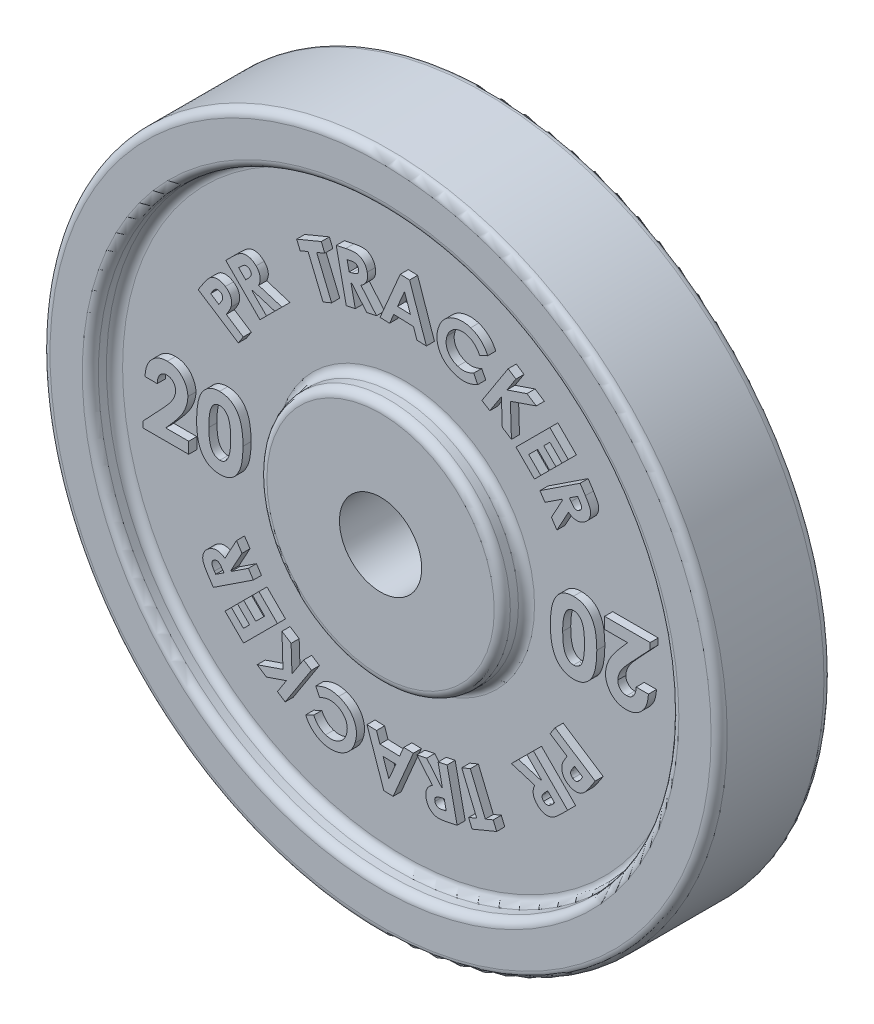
from build123d import *

# Parameters (mm, degrees)
ESBO_O1_R                = 21
ESBO_O1_R_2              = 2.55
RESSALTO_EXTRUS_O1_DEPTH = 7
ESBO_O2_R                = 18
ESBO_O2_R_2              = 7.55
CORTE_EXTRUS_O1_DEPTH    = 1.5
FILETE1_R                = 0.5
RESSALTO_EXTRUS_O2_DEPTH = 0.5
RESSALTO_EXTRUS_O3_DEPTH = 0.5
PADR_OCIRCULAR1_COUNT    = 2
FILETE2_R                = 0.5
FILETE3_R                = 0.5
RESSALTO_EXTRUS_O4_DEPTH = 0.5
RESSALTO_EXTRUS_O5_DEPTH = 0.5
PADR_OCIRCULAR2_COUNT    = 2


with BuildPart() as part:
    # Esbo_o1 → Ressalto-extrus_o1 (new body)
    with BuildSketch(Plane.XY):
        Circle(ESBO_O1_R)
        Circle(ESBO_O1_R_2, mode=Mode.SUBTRACT)
    extrude(amount=RESSALTO_EXTRUS_O1_DEPTH)

    # Esbo_o2 → Corte-extrus_o1 (cut)
    with BuildSketch(Plane.XY.offset(7)):
        Circle(ESBO_O2_R)
        Circle(ESBO_O2_R_2, mode=Mode.SUBTRACT)
    corte_extrus_o1 = extrude(amount=-CORTE_EXTRUS_O1_DEPTH, mode=Mode.SUBTRACT)

    # Filete1
    filete1_edges = [part.edges().sort_by_distance(p)[0] for p in [
        (-7.55, 0, 7),
        (-18, 0, 5.5),
        (-7.55, 0, 5.5),
        (-18, 0, 7),
    ]]
    fillet(filete1_edges, radius=FILETE1_R)

    # Esbo_o3 → Ressalto-extrus_o2 (add)
    # profile 1 of 9: a face of its own
    with BuildSketch(Plane.XY.offset(5.5)):
        with BuildLine():
            Line((11.372106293, 8.482696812), (11.70263514, 7.980893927))
            add(Edge.make_bspline(
                [(11.70263514, 7.980893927), (11.724196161, 7.947521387), (11.76576219, 7.883184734), (11.823642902, 7.789141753), (11.873676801, 7.700688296), (11.916269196, 7.618168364), (11.9531268, 7.542072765), (11.980870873, 7.471076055), (12.003586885, 7.406664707), (12.021625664, 7.328534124), (12.03179376, 7.234371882), (12.026669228, 7.122080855), (12.001764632, 7.010507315), (11.967025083, 6.919591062), (11.931859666, 6.848115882), (11.899674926, 6.79663945), (11.864071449, 6.746943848), (11.824230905, 6.699405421), (11.780243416, 6.653640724), (11.732185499, 6.609991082), (11.680364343, 6.567911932), (11.642951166, 6.542901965), (11.623909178, 6.530172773)],
                knots=[0, 0, 0, 0, 1.424579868, 2.746350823, 3.958867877, 5.067175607, 6.076040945, 6.988342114, 7.799210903, 8.522229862, 9.85875015, 11.181925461, 12.534388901, 13.939130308, 14.6618638, 15.387446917, 16.113030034, 16.852417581, 17.609320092, 18.387197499, 19.179140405, 20, 20, 20, 20], degree=3))
            add(Edge.make_bspline(
                [(11.623909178, 6.530172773), (11.603651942, 6.517253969), (11.563893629, 6.491898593), (11.502471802, 6.459700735), (11.441435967, 6.4320533), (11.380132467, 6.410855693), (11.319315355, 6.393320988), (11.258225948, 6.382908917), (11.197384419, 6.37656645), (11.136436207, 6.37605724), (11.075684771, 6.380787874), (11.01502661, 6.391326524), (10.954290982, 6.40654737), (10.894169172, 6.429160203), (10.833127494, 6.454272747), (10.77304555, 6.486804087), (10.712688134, 6.523926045), (10.673802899, 6.552333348), (10.653957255, 6.566831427)],
                knots=[0, 0, 0, 0, 1.102086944, 2.163035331, 3.179481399, 4.173821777, 5.137300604, 6.080390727, 7.013391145, 7.941897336, 8.873265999, 9.805722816, 10.76445368, 11.741476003, 12.750579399, 13.790977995, 14.872593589, 16, 16, 16, 16], degree=3))
            Line((10.653957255, 6.566831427), (9.936409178, 5.250124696))
            Line((9.936409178, 5.250124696), (9.595663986, 5.766951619))
            Line((9.595663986, 5.766951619), (10.279558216, 7.020557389))
            Line((10.279558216, 7.020557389), (10.250712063, 7.065028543))
            Line((10.250712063, 7.065028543), (9.197827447, 6.370917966))
            Line((9.197827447, 6.370917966), (8.885928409, 6.843874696))
            Line((8.885928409, 6.843874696), (11.372106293, 8.482696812))
        make_face()
        with BuildLine():
            Line((10.712250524, 7.369115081), (10.810207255, 7.220076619))
            add(Edge.make_bspline(
                [(10.810207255, 7.220076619), (10.82222925, 7.201908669), (10.845308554, 7.167030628), (10.881668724, 7.119046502), (10.916195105, 7.076232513), (10.949997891, 7.039374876), (10.982453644, 7.008009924), (11.013544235, 6.981619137), (11.044400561, 6.961738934), (11.083194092, 6.942255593), (11.134321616, 6.929880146), (11.19829258, 6.932687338), (11.264419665, 6.953846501), (11.305669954, 6.978554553), (11.32763514, 6.991711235)],
                knots=[0, 0, 0, 0, 1.203101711, 2.309662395, 3.324143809, 4.240453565, 5.070005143, 5.816667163, 6.488851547, 7.092611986, 8.2090873, 9.349703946, 10.588755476, 12, 12, 12, 12], degree=3))
            add(Edge.make_bspline(
                [(11.32763514, 6.991711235), (11.340342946, 7.000767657), (11.365409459, 7.01863171), (11.397276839, 7.051005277), (11.422317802, 7.087453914), (11.441728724, 7.126408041), (11.454266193, 7.167891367), (11.460187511, 7.210446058), (11.460451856, 7.253814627), (11.452661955, 7.300191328), (11.434169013, 7.353004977), (11.403911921, 7.416123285), (11.360818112, 7.491805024), (11.326138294, 7.545387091), (11.307202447, 7.574643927)],
                knots=[0, 0, 0, 0, 0.842179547, 1.661223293, 2.4389524, 3.223208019, 4.003944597, 4.769372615, 5.537932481, 6.338747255, 7.29721474, 8.551489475, 10.117047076, 12, 12, 12, 12], degree=3))
            Line((11.307202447, 7.574643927), (11.221264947, 7.705052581))
            Line((11.221264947, 7.705052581), (10.712250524, 7.369115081))
        make_face(mode=Mode.SUBTRACT)
    # profile 2 of 9: a face of its own
    with BuildSketch(Plane.XY.offset(5.5)):
        Polygon((9.497131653, 10.539133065), (10.643766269, 9.392498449), (10.252540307, 9.001272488), (9.503141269, 9.750671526), (9.123333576, 9.370863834), (9.872732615, 8.621464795), (9.488718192, 8.237450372), (8.739319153, 8.986849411), (8.187035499, 8.434565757), (8.936434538, 7.685166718), (8.544006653, 7.292738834), (7.397372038, 8.439373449), align=None)
    # profile 3 of 9: a face of its own
    with BuildSketch(Plane.XY.offset(5.5)):
        Polygon((6.914354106, 12.404591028), (7.398128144, 12.092091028), (6.838632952, 11.227307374), (8.080219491, 11.650384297), (8.655940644, 11.277788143), (7.053176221, 10.72550449), (7.11507526, 8.709278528), (6.547767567, 9.075865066), (6.494281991, 10.69425449), (5.771926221, 9.578268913), (5.288152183, 9.890768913), align=None)
    # profile 4 of 9: a face of its own
    with BuildSketch(Plane.XY.offset(5.5)):
        with BuildLine():
            Line((5.643245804, 12.465489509), (5.14564965, 12.22750874))
            add(Edge.make_bspline(
                [(5.14564965, 12.22750874), (5.124240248, 12.270637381), (5.08238287, 12.354957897), (5.00706436, 12.470935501), (4.925885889, 12.576147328), (4.8364413, 12.668755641), (4.740854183, 12.750845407), (4.636864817, 12.819650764), (4.526124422, 12.877448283), (4.447693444, 12.906043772), (4.408269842, 12.920417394)],
                knots=[0, 0, 0, 0, 1.108720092, 2.167651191, 3.18060078, 4.166538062, 5.129360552, 6.078037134, 7.033918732, 8, 8, 8, 8], degree=3))
            add(Edge.make_bspline(
                [(4.408269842, 12.920417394), (4.374572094, 12.930426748), (4.308244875, 12.950128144), (4.20743273, 12.969055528), (4.107941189, 12.976362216), (4.009462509, 12.975892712), (3.912242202, 12.963380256), (3.815944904, 12.941789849), (3.72111022, 12.909667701), (3.628914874, 12.867530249), (3.540271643, 12.818525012), (3.458639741, 12.760702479), (3.383840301, 12.69679356), (3.317503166, 12.624839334), (3.257358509, 12.547286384), (3.205773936, 12.461756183), (3.160882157, 12.369669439), (3.137626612, 12.304480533), (3.125817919, 12.271378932)],
                knots=[0, 0, 0, 0, 1.052060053, 2.070767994, 3.063437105, 4.035120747, 5.014106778, 5.991861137, 6.985689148, 8.005720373, 9.023421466, 10.013478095, 10.995783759, 11.96331235, 12.938580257, 13.929127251, 14.948452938, 16, 16, 16, 16], degree=3))
            add(Edge.make_bspline(
                [(3.125817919, 12.271378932), (3.118498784, 12.247826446), (3.104097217, 12.201483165), (3.088054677, 12.131334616), (3.075938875, 12.062137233), (3.067945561, 11.993527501), (3.06487748, 11.925441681), (3.066897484, 11.858001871), (3.072609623, 11.791291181), (3.083667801, 11.725686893), (3.098584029, 11.661415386), (3.117746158, 11.598917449), (3.141327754, 11.538489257), (3.169232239, 11.47995944), (3.200812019, 11.422929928), (3.237072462, 11.368310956), (3.277089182, 11.31540859), (3.321216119, 11.264964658), (3.368772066, 11.216562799), (3.419521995, 11.171968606), (3.473001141, 11.130439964), (3.529513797, 11.092992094), (3.588517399, 11.057556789), (3.650877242, 11.026911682), (3.715625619, 10.998527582), (3.760506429, 10.983385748), (3.783269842, 10.975705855)],
                knots=[0, 0, 0, 0, 1.08983963, 2.1444336, 3.178001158, 4.193971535, 5.19552419, 6.187598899, 7.174443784, 8.152670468, 9.125633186, 10.089121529, 11.039541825, 11.990127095, 12.953371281, 13.918526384, 14.88546701, 15.883372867, 16.878918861, 17.882661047, 18.867398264, 19.869381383, 20.877721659, 21.907298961, 22.938588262, 24, 24, 24, 24], degree=3))
            add(Edge.make_bspline(
                [(3.783269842, 10.975705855), (3.82212513, 10.96407343), (3.898580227, 10.941184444), (4.015139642, 10.921347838), (4.130158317, 10.915055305), (4.225424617, 10.918680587), (4.301950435, 10.930417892), (4.362185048, 10.942341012), (4.425160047, 10.95866318), (4.490718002, 10.979184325), (4.558828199, 11.004016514), (4.62946354, 11.032959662), (4.703130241, 11.065380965), (4.752502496, 11.089513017), (4.777861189, 11.101907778)],
                knots=[0, 0, 0, 0, 1.412340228, 2.779045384, 4.10748043, 5.421237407, 6.091506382, 6.803337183, 7.560088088, 8.35707087, 9.196132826, 10.085318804, 11.016576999, 12, 12, 12, 12], degree=3))
            Line((4.777861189, 11.101907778), (5.020048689, 10.599503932))
            add(Edge.make_bspline(
                [(5.020048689, 10.599503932), (4.986137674, 10.582965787), (4.91971388, 10.550571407), (4.819970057, 10.508372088), (4.723678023, 10.470788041), (4.630302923, 10.438698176), (4.539814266, 10.412426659), (4.452316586, 10.390824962), (4.367745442, 10.376061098), (4.285510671, 10.365955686), (4.204189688, 10.362076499), (4.122362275, 10.362044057), (4.039098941, 10.366209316), (3.95461992, 10.375168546), (3.868879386, 10.389396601), (3.781937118, 10.407109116), (3.69381468, 10.430250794), (3.635166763, 10.448440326), (3.605385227, 10.457677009)],
                knots=[0, 0, 0, 0, 1.235616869, 2.420286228, 3.546204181, 4.621062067, 5.653067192, 6.631820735, 7.5714333, 8.463446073, 9.343896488, 10.236271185, 11.14293321, 12.073336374, 13.017223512, 13.98880256, 14.978709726, 16, 16, 16, 16], degree=3))
            add(Edge.make_bspline(
                [(3.605385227, 10.457677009), (3.551727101, 10.476565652), (3.446398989, 10.513643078), (3.297649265, 10.584292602), (3.161014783, 10.665870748), (3.035742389, 10.757492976), (2.922155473, 10.860013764), (2.820622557, 10.973645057), (2.731387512, 11.098072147), (2.654896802, 11.231948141), (2.591081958, 11.372150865), (2.543576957, 11.517568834), (2.51058845, 11.665663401), (2.494729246, 11.817233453), (2.49340558, 11.971430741), (2.508187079, 12.128829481), (2.538861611, 12.289174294), (2.570587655, 12.395221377), (2.586755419, 12.449263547)],
                knots=[0, 0, 0, 0, 1.087256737, 2.134228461, 3.142668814, 4.126448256, 5.097398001, 6.063225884, 7.034900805, 8.019872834, 9.007433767, 9.975333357, 10.94012752, 11.903376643, 12.884071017, 13.884292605, 14.921823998, 16, 16, 16, 16], degree=3))
            add(Edge.make_bspline(
                [(2.586755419, 12.449263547), (2.598710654, 12.484095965), (2.622351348, 12.552974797), (2.665512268, 12.65208616), (2.712703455, 12.746597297), (2.765297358, 12.83581344), (2.822358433, 12.920395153), (2.885131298, 12.999649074), (2.952295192, 13.074640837), (3.025439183, 13.143444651), (3.102079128, 13.208027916), (3.183365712, 13.26630797), (3.268736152, 13.318674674), (3.357150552, 13.366279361), (3.450083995, 13.4073008), (3.546606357, 13.442756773), (3.647299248, 13.471979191), (3.750740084, 13.496147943), (3.856160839, 13.5133832), (3.962121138, 13.524247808), (4.067899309, 13.528599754), (4.173333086, 13.525669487), (4.278030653, 13.51504725), (4.38247792, 13.499035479), (4.486764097, 13.475736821), (4.555235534, 13.454541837), (4.589760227, 13.443854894)],
                knots=[0, 0, 0, 0, 1.061962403, 2.099961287, 3.115586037, 4.107642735, 5.085323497, 6.056407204, 7.021973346, 7.986605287, 8.950665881, 9.911273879, 10.868678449, 11.838127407, 12.805645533, 13.796506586, 14.802219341, 15.828295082, 16.859046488, 17.881389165, 18.899230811, 19.910902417, 20.921170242, 21.932973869, 22.95776332, 24, 24, 24, 24], degree=3))
            add(Edge.make_bspline(
                [(4.589760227, 13.443854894), (4.618936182, 13.433780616), (4.676886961, 13.413770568), (4.761345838, 13.377748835), (4.843666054, 13.338236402), (4.923879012, 13.294368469), (5.001343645, 13.245522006), (5.076553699, 13.192561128), (5.149572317, 13.135420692), (5.219496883, 13.073515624), (5.286779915, 13.008408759), (5.349692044, 12.939580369), (5.409691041, 12.868696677), (5.464914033, 12.794246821), (5.515403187, 12.716290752), (5.562227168, 12.635625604), (5.605999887, 12.552367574), (5.630803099, 12.494512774), (5.643245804, 12.465489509)],
                knots=[0, 0, 0, 0, 0.998866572, 1.984000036, 2.970072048, 3.953860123, 4.941572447, 5.932833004, 6.93037271, 7.941144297, 8.954553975, 9.959547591, 10.958329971, 11.959530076, 12.957722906, 13.963113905, 14.978181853, 16, 16, 16, 16], degree=3))
        make_face()
    # profile 5 of 9: a face of its own
    with BuildSketch(Plane.XY.offset(5.5)):
        Polygon((0.221709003, 14.132780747), (0.798031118, 14.112949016), (1.841300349, 11.088910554), (1.251156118, 11.109343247), (1.039617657, 11.732540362), (-0.177329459, 11.775208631), (-0.442353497, 11.168838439), (-1.03309869, 11.189271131), align=None)
        Polygon((0.48613208, 13.331098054), (0.05283881, 12.320881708), (0.84550708, 12.293237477), align=None, mode=Mode.SUBTRACT)
    # profile 6 of 9: a face of its own
    with BuildSketch(Plane.XY.offset(5.5)):
        with BuildLine():
            Line((-3.748977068, 13.699248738), (-3.157630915, 13.825450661))
            add(Edge.make_bspline(
                [(-3.157630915, 13.825450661), (-3.11861599, 13.833511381), (-3.043380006, 13.849055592), (-2.934083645, 13.867484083), (-2.832907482, 13.882026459), (-2.739971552, 13.892808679), (-2.655085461, 13.897468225), (-2.578472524, 13.898277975), (-2.509931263, 13.895221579), (-2.448440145, 13.886614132), (-2.392018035, 13.873700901), (-2.338344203, 13.856855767), (-2.286494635, 13.835739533), (-2.236425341, 13.810444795), (-2.18841238, 13.780791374), (-2.141582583, 13.747562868), (-2.096919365, 13.709826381), (-2.054116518, 13.66827923), (-2.014059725, 13.623221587), (-1.976360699, 13.575329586), (-1.943582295, 13.523161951), (-1.91349983, 13.46837792), (-1.886135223, 13.410817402), (-1.863720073, 13.349652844), (-1.843355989, 13.285833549), (-1.833382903, 13.241604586), (-1.828303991, 13.219080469)],
                knots=[0, 0, 0, 0, 1.704973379, 3.287853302, 4.742851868, 6.079738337, 7.290568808, 8.379457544, 9.358207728, 10.223935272, 11.033000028, 11.832927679, 12.628986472, 13.426521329, 14.230847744, 15.042135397, 15.881916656, 16.730752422, 17.592991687, 18.460754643, 19.335982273, 20.226199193, 21.135209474, 22.060410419, 23.012241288, 24, 24, 24, 24], degree=3))
            add(Edge.make_bspline(
                [(-1.828303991, 13.219080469), (-1.823872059, 13.195484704), (-1.815156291, 13.14908165), (-1.806151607, 13.079895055), (-1.804393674, 13.012561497), (-1.805508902, 12.947236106), (-1.813270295, 12.884248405), (-1.824014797, 12.822858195), (-1.842141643, 12.764069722), (-1.863436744, 12.706792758), (-1.890100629, 12.651605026), (-1.922242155, 12.59876618), (-1.958776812, 12.547363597), (-2.001295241, 12.498744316), (-2.048305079, 12.451798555), (-2.100051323, 12.406492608), (-2.157370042, 12.363888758), (-2.198138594, 12.337636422), (-2.218928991, 12.324248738)],
                knots=[0, 0, 0, 0, 1.09581435, 2.155011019, 3.179669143, 4.167483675, 5.133737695, 6.073368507, 7.007780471, 7.936629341, 8.860786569, 9.800016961, 10.756576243, 11.735379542, 12.74392103, 13.787214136, 14.871564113, 16, 16, 16, 16], degree=3))
            Line((-2.218928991, 12.324248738), (-1.24957803, 11.169801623))
            Line((-1.24957803, 11.169801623), (-1.858352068, 11.040594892))
            Line((-1.858352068, 11.040594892), (-2.78082803, 12.140955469))
            Line((-2.78082803, 12.140955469), (-2.832510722, 12.130138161))
            Line((-2.832510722, 12.130138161), (-2.569289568, 10.889753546))
            Line((-2.569289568, 10.889753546), (-3.126981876, 10.770763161))
            Line((-3.126981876, 10.770763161), (-3.748977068, 13.699248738))
        make_face()
        with BuildLine():
            Line((-2.947895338, 12.673407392), (-2.77301553, 12.710066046))
            add(Edge.make_bspline(
                [(-2.77301553, 12.710066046), (-2.751752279, 12.714951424), (-2.710882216, 12.724341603), (-2.652449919, 12.739833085), (-2.599637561, 12.7564915), (-2.55256387, 12.774327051), (-2.511544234, 12.793726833), (-2.475741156, 12.813396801), (-2.445380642, 12.834177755), (-2.420718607, 12.857047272), (-2.400569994, 12.881222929), (-2.384681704, 12.907606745), (-2.372570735, 12.936138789), (-2.364310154, 12.966885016), (-2.3592735, 12.999749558), (-2.35908776, 13.034847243), (-2.361960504, 13.072080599), (-2.366720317, 13.097320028), (-2.369169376, 13.11030643)],
                knots=[0, 0, 0, 0, 1.598184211, 3.071867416, 4.427024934, 5.653385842, 6.756228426, 7.748257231, 8.643888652, 9.443485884, 10.204445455, 10.941834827, 11.691389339, 12.467479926, 13.268557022, 14.119810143, 15.03258895, 16, 16, 16, 16], degree=3))
            add(Edge.make_bspline(
                [(-2.369169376, 13.11030643), (-2.372857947, 13.125700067), (-2.380042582, 13.155683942), (-2.399338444, 13.197067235), (-2.423545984, 13.234165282), (-2.452965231, 13.266917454), (-2.487429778, 13.29339287), (-2.524430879, 13.316209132), (-2.56574844, 13.330438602), (-2.602384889, 13.339094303), (-2.634940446, 13.342056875), (-2.663868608, 13.342735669), (-2.696718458, 13.340386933), (-2.733862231, 13.337731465), (-2.774906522, 13.332025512), (-2.82036844, 13.324713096), (-2.869883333, 13.315816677), (-2.904241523, 13.308704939), (-2.922053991, 13.305017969)],
                knots=[0, 0, 0, 0, 1.131166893, 2.203297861, 3.249782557, 4.295873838, 5.337726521, 6.353877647, 7.393258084, 8.45137998, 9.042365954, 9.731131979, 10.521344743, 11.399396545, 12.397667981, 13.487316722, 14.697338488, 16, 16, 16, 16], degree=3))
            Line((-2.922053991, 13.305017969), (-3.075299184, 13.272566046))
            Line((-3.075299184, 13.272566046), (-2.947895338, 12.673407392))
        make_face(mode=Mode.SUBTRACT)
    # profile 7 of 9: a face of its own
    with BuildSketch(Plane.XY.offset(5.5)):
        Polygon((-6.202171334, 12.807926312), (-4.675128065, 13.440738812), (-4.459983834, 12.922109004), (-4.963589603, 12.712974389), (-4.033902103, 10.468984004), (-4.566954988, 10.24843112), (-5.496642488, 12.492421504), (-5.987027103, 12.289296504), align=None)
    # profile 8 of 9: a face of its own
    with BuildSketch(Plane.XY.offset(5.5)):
        with BuildLine():
            Line((-10.599505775, 9.467272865), (-10.169818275, 9.895758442))
            add(Edge.make_bspline(
                [(-10.169818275, 9.895758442), (-10.141316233, 9.923753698), (-10.086316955, 9.977775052), (-10.004693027, 10.053245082), (-9.927847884, 10.121209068), (-9.854635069, 10.179596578), (-9.786650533, 10.230950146), (-9.722492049, 10.272906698), (-9.66276536, 10.307043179), (-9.58963716, 10.341521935), (-9.498181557, 10.370464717), (-9.385940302, 10.386720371), (-9.270852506, 10.385232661), (-9.174136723, 10.36969788), (-9.097020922, 10.348445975), (-9.039330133, 10.327835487), (-8.983116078, 10.302648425), (-8.927889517, 10.272904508), (-8.874022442, 10.238562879), (-8.820893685, 10.200242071), (-8.769754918, 10.156522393), (-8.73697313, 10.125088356), (-8.720299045, 10.109099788)],
                knots=[0, 0, 0, 0, 1.421133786, 2.742306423, 3.954344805, 5.069496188, 6.072872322, 6.984049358, 7.794588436, 8.518273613, 9.856972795, 11.189283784, 12.536208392, 13.936227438, 14.660613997, 15.379652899, 16.113338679, 16.849856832, 17.609021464, 18.384434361, 19.178260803, 20, 20, 20, 20], degree=3))
            add(Edge.make_bspline(
                [(-8.720299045, 10.109099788), (-8.703367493, 10.091744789), (-8.670215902, 10.057764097), (-8.626574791, 10.003113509), (-8.587171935, 9.948329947), (-8.552602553, 9.892608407), (-8.524439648, 9.835297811), (-8.501444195, 9.777178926), (-8.483314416, 9.718356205), (-8.470503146, 9.658431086), (-8.463587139, 9.597468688), (-8.460710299, 9.53555021), (-8.464938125, 9.472467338), (-8.473067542, 9.408335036), (-8.487039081, 9.343233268), (-8.506670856, 9.277286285), (-8.530984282, 9.210072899), (-8.551304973, 9.165854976), (-8.561645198, 9.143354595)],
                knots=[0, 0, 0, 0, 1.103197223, 2.160034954, 3.179906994, 4.174678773, 5.141294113, 6.082891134, 7.017573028, 7.940524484, 8.868105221, 9.808155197, 10.758194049, 11.742332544, 12.749361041, 13.785374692, 14.873083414, 16, 16, 16, 16], degree=3))
            Line((-8.561645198, 9.143354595), (-7.116332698, 8.698643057))
            Line((-7.116332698, 8.698643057), (-7.558640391, 8.258138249))
            Line((-7.558640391, 8.258138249), (-8.934842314, 8.681816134))
            Line((-8.934842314, 8.681816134), (-8.972101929, 8.644556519))
            Line((-8.972101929, 8.644556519), (-8.074866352, 7.743715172))
            Line((-8.074866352, 7.743715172), (-8.479914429, 7.339869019))
            Line((-8.479914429, 7.339869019), (-10.599505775, 9.467272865))
        make_face()
        with BuildLine():
            Line((-9.365731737, 9.039388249), (-9.238928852, 9.165590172))
            add(Edge.make_bspline(
                [(-9.238928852, 9.165590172), (-9.223627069, 9.181339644), (-9.1941939, 9.211633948), (-9.153196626, 9.256307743), (-9.118169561, 9.299445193), (-9.087893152, 9.33978526), (-9.063884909, 9.378651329), (-9.04410206, 9.414677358), (-9.030162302, 9.448956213), (-9.018589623, 9.491275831), (-9.016852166, 9.544258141), (-9.031818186, 9.607060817), (-9.066072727, 9.668099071), (-9.098869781, 9.703716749), (-9.116332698, 9.722681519)],
                knots=[0, 0, 0, 0, 1.202674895, 2.313360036, 3.319177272, 4.245179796, 5.073189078, 5.819223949, 6.493567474, 7.094979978, 8.214892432, 9.353828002, 10.591035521, 12, 12, 12, 12], degree=3))
            add(Edge.make_bspline(
                [(-9.116332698, 9.722681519), (-9.127824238, 9.733508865), (-9.150421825, 9.754800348), (-9.189346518, 9.779172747), (-9.230006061, 9.797904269), (-9.272853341, 9.80847089), (-9.316140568, 9.812471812), (-9.359674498, 9.811300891), (-9.402203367, 9.800892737), (-9.43762212, 9.788141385), (-9.46625409, 9.772592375), (-9.490907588, 9.757895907), (-9.517199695, 9.737993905), (-9.546842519, 9.715441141), (-9.578406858, 9.688202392), (-9.612880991, 9.65736726), (-9.649898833, 9.622852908), (-9.674898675, 9.597956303), (-9.687847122, 9.585061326)],
                knots=[0, 0, 0, 0, 1.125004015, 2.212269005, 3.262387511, 4.310165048, 5.344972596, 6.361525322, 7.402641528, 8.457426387, 9.039724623, 9.726656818, 10.504926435, 11.391944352, 12.386519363, 13.4806323, 14.695115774, 16, 16, 16, 16], degree=3))
            Line((-9.687847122, 9.585061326), (-9.799025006, 9.474484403))
            Line((-9.799025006, 9.474484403), (-9.365731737, 9.039388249))
        make_face(mode=Mode.SUBTRACT)
    # profile 9 of 9: a face of its own
    with BuildSketch(Plane.XY.offset(5.5)):
        with BuildLine():
            Line((-12.308870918, 7.044325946), (-11.98134688, 7.546128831))
            add(Edge.make_bspline(
                [(-11.98134688, 7.546128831), (-11.959636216, 7.578665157), (-11.917812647, 7.641343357), (-11.855330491, 7.730623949), (-11.794968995, 7.811310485), (-11.735855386, 7.882605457), (-11.68030535, 7.94608901), (-11.626652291, 8.000619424), (-11.575068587, 8.046433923), (-11.52510025, 8.084536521), (-11.475246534, 8.115763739), (-11.425066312, 8.142230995), (-11.373249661, 8.163866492), (-11.320451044, 8.182383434), (-11.265729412, 8.194956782), (-11.210059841, 8.20521918), (-11.152905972, 8.209628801), (-11.074873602, 8.210581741), (-10.975389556, 8.200198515), (-10.856174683, 8.170027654), (-10.737536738, 8.119701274), (-10.662507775, 8.074349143), (-10.623774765, 8.050936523)],
                knots=[0, 0, 0, 0, 1.407136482, 2.710717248, 3.919990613, 5.030955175, 6.041784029, 6.953954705, 7.781053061, 8.521898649, 9.211703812, 9.895079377, 10.560316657, 11.230338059, 11.905032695, 12.577993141, 13.26504473, 13.964123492, 15.383954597, 16.848671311, 18.373155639, 20, 20, 20, 20], degree=3))
            add(Edge.make_bspline(
                [(-10.623774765, 8.050936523), (-10.602739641, 8.036594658), (-10.561692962, 8.0086088), (-10.504605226, 7.962631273), (-10.45359978, 7.913595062), (-10.406916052, 7.863064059), (-10.367281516, 7.808759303), (-10.331957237, 7.752813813), (-10.302615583, 7.694018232), (-10.279094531, 7.632979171), (-10.261259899, 7.570345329), (-10.247856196, 7.50671609), (-10.240040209, 7.441975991), (-10.237618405, 7.376441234), (-10.240851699, 7.310158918), (-10.248630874, 7.243056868), (-10.261786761, 7.174910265), (-10.274673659, 7.129776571), (-10.281226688, 7.106825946)],
                knots=[0, 0, 0, 0, 1.124608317, 2.194493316, 3.233698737, 4.248804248, 5.229486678, 6.199567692, 7.169325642, 8.127585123, 9.085599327, 10.043777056, 10.997776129, 11.963162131, 12.9377548, 13.92690783, 14.945826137, 16, 16, 16, 16], degree=3))
            add(Edge.make_bspline(
                [(-10.281226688, 7.106825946), (-10.286271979, 7.092141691), (-10.297181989, 7.060388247), (-10.318515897, 7.010437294), (-10.346025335, 6.954630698), (-10.378136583, 6.891893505), (-10.417824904, 6.823723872), (-10.461958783, 6.748474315), (-10.512639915, 6.667567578), (-10.548589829, 6.611791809), (-10.56728438, 6.582787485)],
                knots=[0, 0, 0, 0, 0.622537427, 1.346183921, 2.176173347, 3.117576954, 4.171813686, 5.338785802, 6.616124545, 8, 8, 8, 8], degree=3))
            Line((-10.56728438, 6.582787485), (-9.514399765, 5.896489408))
            Line((-9.514399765, 5.896489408), (-9.822693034, 5.423532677))
            Line((-9.822693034, 5.423532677), (-12.308870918, 7.044325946))
        make_face()
        with BuildLine():
            Line((-11.028822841, 6.883869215), (-10.930265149, 7.034710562))
            add(Edge.make_bspline(
                [(-10.930265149, 7.034710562), (-10.912702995, 7.062157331), (-10.880443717, 7.112573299), (-10.840977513, 7.184219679), (-10.811208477, 7.243531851), (-10.794506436, 7.294263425), (-10.787318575, 7.338945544), (-10.787502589, 7.380666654), (-10.793223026, 7.421802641), (-10.806926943, 7.461344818), (-10.825809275, 7.499358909), (-10.8519373, 7.534169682), (-10.883729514, 7.566495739), (-10.90929918, 7.583999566), (-10.922452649, 7.593003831)],
                knots=[0, 0, 0, 0, 1.82986352, 3.361209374, 4.594483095, 5.551825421, 6.349238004, 7.125730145, 7.888067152, 8.670975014, 9.466161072, 10.26293814, 11.106426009, 12, 12, 12, 12], degree=3))
            add(Edge.make_bspline(
                [(-10.922452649, 7.593003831), (-10.934309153, 7.600318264), (-10.957170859, 7.614421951), (-10.993212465, 7.630081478), (-11.028808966, 7.641335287), (-11.064689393, 7.646638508), (-11.100257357, 7.647302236), (-11.135694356, 7.643086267), (-11.17099314, 7.633435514), (-11.193419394, 7.622991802), (-11.204904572, 7.617643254)],
                knots=[0, 0, 0, 0, 1.120226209, 2.160019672, 3.154816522, 4.117323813, 5.068961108, 6.011122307, 6.981434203, 8, 8, 8, 8], degree=3))
            add(Edge.make_bspline(
                [(-11.204904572, 7.617643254), (-11.213847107, 7.612843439), (-11.232650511, 7.602750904), (-11.260106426, 7.582112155), (-11.288481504, 7.556232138), (-11.318961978, 7.525451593), (-11.349627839, 7.488436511), (-11.383023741, 7.447308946), (-11.416466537, 7.399919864), (-11.438948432, 7.366486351), (-11.450697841, 7.349013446)],
                knots=[0, 0, 0, 0, 0.661727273, 1.391409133, 2.234074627, 3.167977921, 4.216097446, 5.369899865, 6.625466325, 8, 8, 8, 8], degree=3))
            Line((-11.450697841, 7.349013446), (-11.537837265, 7.215599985))
            Line((-11.537837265, 7.215599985), (-11.028822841, 6.883869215))
        make_face(mode=Mode.SUBTRACT)
    ressalto_extrus_o2 = extrude(amount=RESSALTO_EXTRUS_O2_DEPTH)

    # Esbo_o5 → Ressalto-extrus_o3 (add)
    # profile 1 of 2: a face of its own
    with BuildSketch(Plane.XY.offset(5.5)):
        with BuildLine():
            Line((-14.851889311, 0.722222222), (-15.611718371, 0.722222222))
            add(Edge.make_bspline(
                [(-15.611718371, 0.722222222), (-15.608436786, 0.779699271), (-15.602024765, 0.892005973), (-15.576519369, 1.055135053), (-15.542343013, 1.209274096), (-15.496730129, 1.353883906), (-15.439414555, 1.488911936), (-15.37187117, 1.614818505), (-15.292374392, 1.730940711), (-15.202616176, 1.836718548), (-15.104120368, 1.931612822), (-14.998931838, 2.015752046), (-14.885441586, 2.085181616), (-14.765723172, 2.142315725), (-14.639796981, 2.187963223), (-14.506471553, 2.218482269), (-14.366901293, 2.239150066), (-14.271354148, 2.240958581), (-14.222655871, 2.241880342)],
                knots=[0, 0, 0, 0, 1.199038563, 2.342849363, 3.436047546, 4.486744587, 5.497670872, 6.488682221, 7.459191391, 8.424610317, 9.374430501, 10.305433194, 11.225809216, 12.140057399, 13.06607119, 14.010487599, 14.985989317, 16, 16, 16, 16], degree=3))
            add(Edge.make_bspline(
                [(-14.222655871, 2.241880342), (-14.162879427, 2.240015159), (-14.0461818, 2.236373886), (-13.876610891, 2.205312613), (-13.718250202, 2.153357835), (-13.571214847, 2.080763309), (-13.436756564, 1.988539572), (-13.314897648, 1.87857786), (-13.209323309, 1.748571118), (-13.119364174, 1.603928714), (-13.044618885, 1.450772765), (-12.992240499, 1.292403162), (-12.95781275, 1.133022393), (-12.954140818, 1.025703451), (-12.952316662, 0.972389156)],
                knots=[0, 0, 0, 0, 1.075374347, 2.099382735, 3.09057751, 4.06680945, 5.040638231, 6.016817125, 7.011024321, 8.044445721, 9.0776792, 10.070479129, 11.0414456, 12, 12, 12, 12], degree=3))
            add(Edge.make_bspline(
                [(-12.952316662, 0.972389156), (-12.953026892, 0.940140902), (-12.954456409, 0.875233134), (-12.964396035, 0.777011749), (-12.979307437, 0.676961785), (-13.001790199, 0.575169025), (-13.029828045, 0.471604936), (-13.063842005, 0.365959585), (-13.104621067, 0.258831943), (-13.151484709, 0.149016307), (-13.207393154, 0.036156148), (-13.272490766, -0.081440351), (-13.348505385, -0.203668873), (-13.434518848, -0.331219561), (-13.530948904, -0.463891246), (-13.638266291, -0.601284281), (-13.755234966, -0.743882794), (-13.838250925, -0.839201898), (-13.880902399, -0.888174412)],
                knots=[0, 0, 0, 0, 0.728284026, 1.46585585, 2.227944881, 3.01186502, 3.81876927, 4.650621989, 5.517437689, 6.406905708, 7.346299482, 8.360816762, 9.441613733, 10.596154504, 11.834900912, 13.145207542, 14.533280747, 16, 16, 16, 16], degree=3))
            Line((-13.880902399, -0.888174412), (-14.322722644, -1.394444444))
            Line((-14.322722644, -1.394444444), (-12.898043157, -1.394444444))
            Line((-12.898043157, -1.394444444), (-12.898043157, -2.1))
            Line((-12.898043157, -2.1), (-15.72026538, -2.1))
            Line((-15.72026538, -2.1), (-15.72026538, -1.714997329))
            Line((-15.72026538, -1.714997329), (-14.46688664, -0.381056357))
            add(Edge.make_bspline(
                [(-14.46688664, -0.381056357), (-14.430598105, -0.342144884), (-14.360317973, -0.266784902), (-14.260316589, -0.15611075), (-14.169824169, -0.051083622), (-14.090717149, 0.04941481), (-14.018844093, 0.142124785), (-13.957409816, 0.229840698), (-13.905852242, 0.311769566), (-13.849879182, 0.410561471), (-13.796723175, 0.528388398), (-13.747949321, 0.664129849), (-13.718218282, 0.793867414), (-13.714114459, 0.8784072), (-13.712145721, 0.918963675)],
                knots=[0, 0, 0, 0, 1.246127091, 2.413378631, 3.493388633, 4.492180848, 5.408488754, 6.240484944, 6.999099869, 7.674939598, 8.898438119, 10.020720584, 11.050475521, 12, 12, 12, 12], degree=3))
            add(Edge.make_bspline(
                [(-13.712145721, 0.918963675), (-13.713617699, 0.958198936), (-13.71646989, 1.034223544), (-13.747813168, 1.142368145), (-13.79637126, 1.240282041), (-13.86479647, 1.325039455), (-13.94768083, 1.394690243), (-14.043461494, 1.446494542), (-14.151357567, 1.476385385), (-14.22699477, 1.48012665), (-14.26590507, 1.482051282)],
                knots=[0, 0, 0, 0, 1.062038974, 2.057870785, 3.028805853, 4.01125022, 4.991535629, 5.949134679, 6.94496649, 8, 8, 8, 8], degree=3))
            add(Edge.make_bspline(
                [(-14.26590507, 1.482051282), (-14.286006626, 1.4813403), (-14.325579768, 1.479940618), (-14.383749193, 1.470623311), (-14.43910158, 1.454202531), (-14.492253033, 1.432200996), (-14.542636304, 1.403037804), (-14.59012431, 1.367089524), (-14.6352174, 1.325269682), (-14.677708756, 1.277709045), (-14.716381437, 1.22463136), (-14.750730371, 1.166521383), (-14.779131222, 1.103415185), (-14.804136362, 1.036145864), (-14.823421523, 0.963990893), (-14.837463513, 0.887382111), (-14.8481387, 0.806444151), (-14.850616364, 0.750806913), (-14.851889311, 0.722222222)],
                knots=[0, 0, 0, 0, 0.903469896, 1.778625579, 2.63899355, 3.493148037, 4.358286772, 5.247621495, 6.164656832, 7.118446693, 8.109501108, 9.111810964, 10.146451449, 11.215617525, 12.33435995, 13.498009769, 14.714554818, 16, 16, 16, 16], degree=3))
        make_face()
    # profile 2 of 2: a face of its own
    with BuildSketch(Plane.XY.offset(5.5)):
        with BuildLine():
            add(Edge.make_bspline(
                [(-10.984054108, 2.241880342), (-10.947275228, 2.241334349), (-10.874958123, 2.240260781), (-10.76844864, 2.228633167), (-10.66585056, 2.211067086), (-10.566762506, 2.186568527), (-10.471897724, 2.154145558), (-10.38056577, 2.115335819), (-10.293853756, 2.068103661), (-10.210655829, 2.014752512), (-10.131004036, 1.954351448), (-10.056812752, 1.885491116), (-9.986727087, 1.809755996), (-9.922264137, 1.726001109), (-9.86199635, 1.634988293), (-9.806121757, 1.536703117), (-9.755068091, 1.430664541), (-9.708263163, 1.31668121), (-9.666410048, 1.193044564), (-9.631157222, 1.058336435), (-9.600922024, 0.912526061), (-9.575401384, 0.755250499), (-9.556111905, 0.58630069), (-9.543110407, 0.405788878), (-9.534188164, 0.214063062), (-9.533459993, 0.082540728), (-9.533085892, 0.01497062)],
                knots=[0, 0, 0, 0, 0.879237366, 1.728815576, 2.559023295, 3.367336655, 4.166867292, 4.954216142, 5.737608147, 6.525189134, 7.316157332, 8.124696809, 8.942788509, 9.781158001, 10.649253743, 11.551476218, 12.482711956, 13.461909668, 14.496590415, 15.601789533, 16.789733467, 18.056700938, 19.410929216, 20.8549011, 22.384193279, 24, 24, 24, 24], degree=3))
            add(Edge.make_bspline(
                [(-9.533085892, 0.01497062), (-9.533490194, -0.053444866), (-9.534275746, -0.186374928), (-9.542739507, -0.379854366), (-9.557314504, -0.561676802), (-9.576099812, -0.731823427), (-9.601830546, -0.890204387), (-9.631964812, -1.037229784), (-9.667774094, -1.172846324), (-9.711005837, -1.296748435), (-9.757527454, -1.410931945), (-9.808720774, -1.516763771), (-9.863693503, -1.614530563), (-9.921184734, -1.705707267), (-9.984346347, -1.787606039), (-10.050104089, -1.863011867), (-10.121321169, -1.929052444), (-10.194999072, -1.989131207), (-10.273836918, -2.041051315), (-10.357021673, -2.086459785), (-10.446036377, -2.123291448), (-10.539258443, -2.155325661), (-10.638276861, -2.178322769), (-10.741518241, -2.196570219), (-10.850148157, -2.206654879), (-10.924107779, -2.207905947), (-10.962005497, -2.208547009)],
                knots=[0, 0, 0, 0, 1.643780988, 3.193836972, 4.651895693, 6.025988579, 7.305620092, 8.505800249, 9.631074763, 10.672816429, 11.65661981, 12.592235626, 13.49536222, 14.350718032, 15.179365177, 15.97804903, 16.751647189, 17.51006938, 18.259804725, 19.016521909, 19.783502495, 20.571750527, 21.382245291, 22.22305063, 23.089471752, 24, 24, 24, 24], degree=3))
            add(Edge.make_bspline(
                [(-10.962005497, -2.208547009), (-10.999902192, -2.207893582), (-11.074141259, -2.206613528), (-11.183064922, -2.196645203), (-11.286853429, -2.178248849), (-11.386655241, -2.155149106), (-11.481775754, -2.123362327), (-11.572671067, -2.085428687), (-11.658642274, -2.040303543), (-11.739927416, -1.988262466), (-11.816248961, -1.928585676), (-11.888792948, -1.861911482), (-11.957398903, -1.788408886), (-12.02102316, -1.707254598), (-12.080707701, -1.61953186), (-12.135830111, -1.524238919), (-12.186357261, -1.421514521), (-12.23386965, -1.311215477), (-12.275151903, -1.190967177), (-12.311891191, -1.059695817), (-12.341987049, -0.916307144), (-12.366192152, -0.760847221), (-12.385517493, -0.593645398), (-12.399893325, -0.414620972), (-12.408404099, -0.223690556), (-12.409181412, -0.09245457), (-12.409581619, -0.024886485)],
                knots=[0, 0, 0, 0, 0.917216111, 1.796812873, 2.643793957, 3.46689424, 4.273913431, 5.068098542, 5.848489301, 6.620921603, 7.401012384, 8.190319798, 9.003608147, 9.831726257, 10.68377682, 11.569763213, 12.493818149, 13.453288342, 14.474581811, 15.568529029, 16.750744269, 18.018426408, 19.375425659, 20.823733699, 22.36466933, 24, 24, 24, 24], degree=3))
            add(Edge.make_bspline(
                [(-12.409581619, -0.024886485), (-12.408856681, 0.06899405), (-12.407457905, 0.250137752), (-12.389731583, 0.511837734), (-12.363713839, 0.753734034), (-12.325499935, 0.97542202), (-12.278248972, 1.177722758), (-12.217741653, 1.359303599), (-12.148858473, 1.522677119), (-12.090161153, 1.619460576), (-12.061891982, 1.666072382)],
                knots=[0, 0, 0, 0, 1.288568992, 2.486310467, 3.599230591, 4.627010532, 5.572937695, 6.447898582, 7.252493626, 8, 8, 8, 8], degree=3))
            add(Edge.make_bspline(
                [(-12.061891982, 1.666072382), (-12.029021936, 1.711863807), (-11.96475452, 1.801395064), (-11.852381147, 1.918932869), (-11.731650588, 2.019456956), (-11.600083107, 2.100692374), (-11.459759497, 2.164754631), (-11.309475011, 2.210001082), (-11.149784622, 2.236363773), (-11.040122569, 2.240014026), (-10.984054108, 2.241880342)],
                knots=[0, 0, 0, 0, 1.058512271, 2.069600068, 3.047294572, 4.004278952, 4.967380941, 5.939006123, 6.946246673, 8, 8, 8, 8], degree=3))
        make_face()
        with BuildLine():
            add(Edge.make_bspline(
                [(-10.965397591, 1.482051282), (-10.998646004, 1.480475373), (-11.063830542, 1.477385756), (-11.158416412, 1.451159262), (-11.247604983, 1.410651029), (-11.315448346, 1.361905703), (-11.366228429, 1.315177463), (-11.401708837, 1.272889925), (-11.435924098, 1.225700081), (-11.46614474, 1.171478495), (-11.494680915, 1.112173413), (-11.522569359, 1.047515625), (-11.54543056, 0.975916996), (-11.567891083, 0.898596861), (-11.587568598, 0.813417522), (-11.604054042, 0.719682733), (-11.618782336, 0.616782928), (-11.629055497, 0.504650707), (-11.638633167, 0.383403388), (-11.645498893, 0.25277088), (-11.648369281, 0.112788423), (-11.64928169, 0.016384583), (-11.649752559, -0.03336672)],
                knots=[0, 0, 0, 0, 1.076674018, 2.110852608, 3.161083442, 4.239746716, 4.804137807, 5.395870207, 6.026861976, 6.692161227, 7.405688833, 8.16177676, 8.973626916, 9.841385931, 10.773283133, 11.807421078, 12.927755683, 14.143907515, 15.458935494, 16.872852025, 18.386167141, 20, 20, 20, 20], degree=3))
            add(Edge.make_bspline(
                [(-11.649752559, -0.03336672), (-11.648977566, -0.097821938), (-11.647491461, -0.221419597), (-11.639707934, -0.399157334), (-11.624106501, -0.560912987), (-11.604701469, -0.707782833), (-11.577446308, -0.838814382), (-11.546087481, -0.955247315), (-11.507362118, -1.055597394), (-11.462607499, -1.141315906), (-11.413039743, -1.214236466), (-11.359231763, -1.276219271), (-11.303015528, -1.329893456), (-11.242636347, -1.373492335), (-11.178238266, -1.406904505), (-11.110358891, -1.430937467), (-11.038955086, -1.445649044), (-10.990058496, -1.447689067), (-10.965397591, -1.448717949)],
                knots=[0, 0, 0, 0, 1.771748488, 3.397459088, 4.888034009, 6.237357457, 7.467047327, 8.564189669, 9.548206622, 10.417051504, 11.216568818, 11.965764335, 12.669334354, 13.348544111, 14.005342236, 14.656555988, 15.322436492, 16, 16, 16, 16], degree=3))
            add(Edge.make_bspline(
                [(-10.965397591, -1.448717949), (-10.94158297, -1.448013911), (-10.894956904, -1.446635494), (-10.826965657, -1.432486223), (-10.762668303, -1.409482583), (-10.702258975, -1.376942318), (-10.645521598, -1.335562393), (-10.592733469, -1.285160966), (-10.544292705, -1.225235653), (-10.516070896, -1.180762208), (-10.501528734, -1.157845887)],
                knots=[0, 0, 0, 0, 0.992283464, 1.942767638, 2.88273346, 3.832339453, 4.79467288, 5.803907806, 6.868395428, 8, 8, 8, 8], degree=3))
            add(Edge.make_bspline(
                [(-10.501528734, -1.157845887), (-10.484407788, -1.126531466), (-10.448506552, -1.060867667), (-10.40696158, -0.950062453), (-10.371991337, -0.825092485), (-10.341892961, -0.685568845), (-10.321307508, -0.530941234), (-10.303579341, -0.36219016), (-10.295028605, -0.17846586), (-10.293637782, -0.051181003), (-10.292914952, 0.01497062)],
                knots=[0, 0, 0, 0, 0.710965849, 1.490837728, 2.352621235, 3.297892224, 4.334225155, 5.461620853, 6.680770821, 8, 8, 8, 8], degree=3))
            add(Edge.make_bspline(
                [(-10.292914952, 0.01497062), (-10.293194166, 0.08169647), (-10.293731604, 0.210132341), (-10.303592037, 0.394517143), (-10.317323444, 0.562922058), (-10.337408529, 0.714971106), (-10.363251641, 0.851033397), (-10.395103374, 0.971100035), (-10.432654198, 1.075407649), (-10.477185, 1.16385223), (-10.52650563, 1.239017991), (-10.578860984, 1.303504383), (-10.634472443, 1.358561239), (-10.693247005, 1.404395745), (-10.756545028, 1.439416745), (-10.823157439, 1.464144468), (-10.893220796, 1.479103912), (-10.941013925, 1.481055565), (-10.965397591, 1.482051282)],
                knots=[0, 0, 0, 0, 1.793836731, 3.452829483, 4.963243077, 6.335886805, 7.574563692, 8.684454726, 9.672768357, 10.54971625, 11.340229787, 12.085688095, 12.778991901, 13.440269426, 14.083255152, 14.715733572, 15.344777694, 16, 16, 16, 16], degree=3))
        make_face(mode=Mode.SUBTRACT)
    ressalto_extrus_o3 = extrude(amount=RESSALTO_EXTRUS_O3_DEPTH)

    # Padr_oCircular1: Ressalto-extrus_o2, Ressalto-extrus_o3 ×2 about axis
    padr_ocircular1_axis = Axis((0, 0, 7), (0, 0, 1))
    add([ressalto_extrus_o2.rotate(padr_ocircular1_axis, i * 360 / PADR_OCIRCULAR1_COUNT) for i in range(1, PADR_OCIRCULAR1_COUNT)])
    add([ressalto_extrus_o3.rotate(padr_ocircular1_axis, i * 360 / PADR_OCIRCULAR1_COUNT) for i in range(1, PADR_OCIRCULAR1_COUNT)])

    # Filete2
    filete2_edges = [part.edges().sort_by_distance(p)[0] for p in [
        (-21, 0, 0),
        (-21, 0, 7),
    ]]
    fillet(filete2_edges, radius=FILETE2_R)

    # Espelhar6: Corte-extrus_o1 across plane
    add(corte_extrus_o1.mirror(Plane.XY.offset(3.5)), mode=Mode.SUBTRACT)

    # Filete3
    filete3_edges = [part.edges().sort_by_distance(p)[0] for p in [
        (-7.55, 0, 1.5),
        (-18, 0, 0),
        (-18, 0, 1.5),
        (-7.55, 0, 0),
    ]]
    fillet(filete3_edges, radius=FILETE3_R)

    # Esbo_o10 → Ressalto-extrus_o4 (add)
    # profile 1 of 9: a face of its own
    with BuildSketch(Plane(origin=(0, 0, 1.5), x_dir=(-1, 0, 0), z_dir=(0, 0, -1))):
        with BuildLine():
            Line((11.372106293, 8.482696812), (11.70263514, 7.980893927))
            add(Edge.make_bspline(
                [(11.70263514, 7.980893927), (11.724196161, 7.947521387), (11.76576219, 7.883184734), (11.823642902, 7.789141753), (11.873676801, 7.700688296), (11.916269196, 7.618168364), (11.9531268, 7.542072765), (11.980870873, 7.471076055), (12.003586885, 7.406664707), (12.021625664, 7.328534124), (12.03179376, 7.234371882), (12.026669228, 7.122080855), (12.001764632, 7.010507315), (11.967025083, 6.919591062), (11.931859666, 6.848115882), (11.899674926, 6.79663945), (11.864071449, 6.746943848), (11.824230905, 6.699405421), (11.780243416, 6.653640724), (11.732185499, 6.609991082), (11.680364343, 6.567911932), (11.642951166, 6.542901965), (11.623909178, 6.530172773)],
                knots=[0, 0, 0, 0, 1.424579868, 2.746350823, 3.958867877, 5.067175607, 6.076040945, 6.988342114, 7.799210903, 8.522229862, 9.85875015, 11.181925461, 12.534388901, 13.939130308, 14.6618638, 15.387446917, 16.113030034, 16.852417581, 17.609320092, 18.387197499, 19.179140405, 20, 20, 20, 20], degree=3))
            add(Edge.make_bspline(
                [(11.623909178, 6.530172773), (11.603651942, 6.517253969), (11.563893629, 6.491898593), (11.502471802, 6.459700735), (11.441435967, 6.4320533), (11.380132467, 6.410855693), (11.319315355, 6.393320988), (11.258225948, 6.382908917), (11.197384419, 6.37656645), (11.136436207, 6.37605724), (11.075684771, 6.380787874), (11.01502661, 6.391326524), (10.954290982, 6.40654737), (10.894169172, 6.429160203), (10.833127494, 6.454272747), (10.77304555, 6.486804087), (10.712688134, 6.523926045), (10.673802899, 6.552333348), (10.653957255, 6.566831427)],
                knots=[0, 0, 0, 0, 1.102086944, 2.163035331, 3.179481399, 4.173821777, 5.137300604, 6.080390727, 7.013391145, 7.941897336, 8.873265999, 9.805722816, 10.76445368, 11.741476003, 12.750579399, 13.790977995, 14.872593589, 16, 16, 16, 16], degree=3))
            Line((10.653957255, 6.566831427), (9.936409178, 5.250124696))
            Line((9.936409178, 5.250124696), (9.595663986, 5.766951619))
            Line((9.595663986, 5.766951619), (10.279558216, 7.020557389))
            Line((10.279558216, 7.020557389), (10.250712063, 7.065028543))
            Line((10.250712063, 7.065028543), (9.197827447, 6.370917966))
            Line((9.197827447, 6.370917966), (8.885928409, 6.843874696))
            Line((8.885928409, 6.843874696), (11.372106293, 8.482696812))
        make_face()
        with BuildLine():
            Line((10.712250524, 7.369115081), (10.810207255, 7.220076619))
            add(Edge.make_bspline(
                [(10.810207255, 7.220076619), (10.82222925, 7.201908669), (10.845308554, 7.167030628), (10.881668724, 7.119046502), (10.916195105, 7.076232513), (10.949997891, 7.039374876), (10.982453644, 7.008009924), (11.013544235, 6.981619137), (11.044400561, 6.961738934), (11.083194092, 6.942255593), (11.134321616, 6.929880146), (11.19829258, 6.932687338), (11.264419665, 6.953846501), (11.305669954, 6.978554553), (11.32763514, 6.991711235)],
                knots=[0, 0, 0, 0, 1.203101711, 2.309662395, 3.324143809, 4.240453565, 5.070005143, 5.816667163, 6.488851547, 7.092611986, 8.2090873, 9.349703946, 10.588755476, 12, 12, 12, 12], degree=3))
            add(Edge.make_bspline(
                [(11.32763514, 6.991711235), (11.340342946, 7.000767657), (11.365409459, 7.01863171), (11.397276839, 7.051005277), (11.422317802, 7.087453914), (11.441728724, 7.126408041), (11.454266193, 7.167891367), (11.460187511, 7.210446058), (11.460451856, 7.253814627), (11.452661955, 7.300191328), (11.434169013, 7.353004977), (11.403911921, 7.416123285), (11.360818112, 7.491805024), (11.326138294, 7.545387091), (11.307202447, 7.574643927)],
                knots=[0, 0, 0, 0, 0.842179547, 1.661223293, 2.4389524, 3.223208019, 4.003944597, 4.769372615, 5.537932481, 6.338747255, 7.29721474, 8.551489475, 10.117047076, 12, 12, 12, 12], degree=3))
            Line((11.307202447, 7.574643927), (11.221264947, 7.705052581))
            Line((11.221264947, 7.705052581), (10.712250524, 7.369115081))
        make_face(mode=Mode.SUBTRACT)
    # profile 2 of 9: a face of its own
    with BuildSketch(Plane(origin=(0, 0, 1.5), x_dir=(-1, 0, 0), z_dir=(0, 0, -1))):
        Polygon((9.497131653, 10.539133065), (10.643766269, 9.392498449), (10.252540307, 9.001272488), (9.503141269, 9.750671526), (9.123333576, 9.370863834), (9.872732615, 8.621464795), (9.488718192, 8.237450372), (8.739319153, 8.986849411), (8.187035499, 8.434565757), (8.936434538, 7.685166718), (8.544006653, 7.292738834), (7.397372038, 8.439373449), align=None)
    # profile 3 of 9: a face of its own
    with BuildSketch(Plane(origin=(0, 0, 1.5), x_dir=(-1, 0, 0), z_dir=(0, 0, -1))):
        Polygon((6.914354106, 12.404591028), (7.398128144, 12.092091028), (6.838632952, 11.227307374), (8.080219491, 11.650384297), (8.655940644, 11.277788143), (7.053176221, 10.72550449), (7.11507526, 8.709278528), (6.547767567, 9.075865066), (6.494281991, 10.69425449), (5.771926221, 9.578268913), (5.288152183, 9.890768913), align=None)
    # profile 4 of 9: a face of its own
    with BuildSketch(Plane(origin=(0, 0, 1.5), x_dir=(-1, 0, 0), z_dir=(0, 0, -1))):
        with BuildLine():
            Line((5.643245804, 12.465489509), (5.14564965, 12.22750874))
            add(Edge.make_bspline(
                [(5.14564965, 12.22750874), (5.124240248, 12.270637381), (5.08238287, 12.354957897), (5.00706436, 12.470935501), (4.925885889, 12.576147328), (4.8364413, 12.668755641), (4.740854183, 12.750845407), (4.636864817, 12.819650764), (4.526124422, 12.877448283), (4.447693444, 12.906043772), (4.408269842, 12.920417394)],
                knots=[0, 0, 0, 0, 1.108720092, 2.167651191, 3.18060078, 4.166538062, 5.129360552, 6.078037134, 7.033918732, 8, 8, 8, 8], degree=3))
            add(Edge.make_bspline(
                [(4.408269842, 12.920417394), (4.374572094, 12.930426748), (4.308244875, 12.950128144), (4.20743273, 12.969055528), (4.107941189, 12.976362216), (4.009462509, 12.975892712), (3.912242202, 12.963380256), (3.815944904, 12.941789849), (3.72111022, 12.909667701), (3.628914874, 12.867530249), (3.540271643, 12.818525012), (3.458639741, 12.760702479), (3.383840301, 12.69679356), (3.317503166, 12.624839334), (3.257358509, 12.547286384), (3.205773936, 12.461756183), (3.160882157, 12.369669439), (3.137626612, 12.304480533), (3.125817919, 12.271378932)],
                knots=[0, 0, 0, 0, 1.052060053, 2.070767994, 3.063437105, 4.035120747, 5.014106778, 5.991861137, 6.985689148, 8.005720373, 9.023421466, 10.013478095, 10.995783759, 11.96331235, 12.938580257, 13.929127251, 14.948452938, 16, 16, 16, 16], degree=3))
            add(Edge.make_bspline(
                [(3.125817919, 12.271378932), (3.118498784, 12.247826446), (3.104097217, 12.201483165), (3.088054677, 12.131334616), (3.075938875, 12.062137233), (3.067945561, 11.993527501), (3.06487748, 11.925441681), (3.066897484, 11.858001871), (3.072609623, 11.791291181), (3.083667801, 11.725686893), (3.098584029, 11.661415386), (3.117746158, 11.598917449), (3.141327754, 11.538489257), (3.169232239, 11.47995944), (3.200812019, 11.422929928), (3.237072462, 11.368310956), (3.277089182, 11.31540859), (3.321216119, 11.264964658), (3.368772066, 11.216562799), (3.419521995, 11.171968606), (3.473001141, 11.130439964), (3.529513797, 11.092992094), (3.588517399, 11.057556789), (3.650877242, 11.026911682), (3.715625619, 10.998527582), (3.760506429, 10.983385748), (3.783269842, 10.975705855)],
                knots=[0, 0, 0, 0, 1.08983963, 2.1444336, 3.178001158, 4.193971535, 5.19552419, 6.187598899, 7.174443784, 8.152670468, 9.125633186, 10.089121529, 11.039541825, 11.990127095, 12.953371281, 13.918526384, 14.88546701, 15.883372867, 16.878918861, 17.882661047, 18.867398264, 19.869381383, 20.877721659, 21.907298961, 22.938588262, 24, 24, 24, 24], degree=3))
            add(Edge.make_bspline(
                [(3.783269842, 10.975705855), (3.82212513, 10.96407343), (3.898580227, 10.941184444), (4.015139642, 10.921347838), (4.130158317, 10.915055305), (4.225424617, 10.918680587), (4.301950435, 10.930417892), (4.362185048, 10.942341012), (4.425160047, 10.95866318), (4.490718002, 10.979184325), (4.558828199, 11.004016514), (4.62946354, 11.032959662), (4.703130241, 11.065380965), (4.752502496, 11.089513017), (4.777861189, 11.101907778)],
                knots=[0, 0, 0, 0, 1.412340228, 2.779045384, 4.10748043, 5.421237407, 6.091506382, 6.803337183, 7.560088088, 8.35707087, 9.196132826, 10.085318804, 11.016576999, 12, 12, 12, 12], degree=3))
            Line((4.777861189, 11.101907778), (5.020048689, 10.599503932))
            add(Edge.make_bspline(
                [(5.020048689, 10.599503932), (4.986137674, 10.582965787), (4.91971388, 10.550571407), (4.819970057, 10.508372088), (4.723678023, 10.470788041), (4.630302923, 10.438698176), (4.539814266, 10.412426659), (4.452316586, 10.390824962), (4.367745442, 10.376061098), (4.285510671, 10.365955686), (4.204189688, 10.362076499), (4.122362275, 10.362044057), (4.039098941, 10.366209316), (3.95461992, 10.375168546), (3.868879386, 10.389396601), (3.781937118, 10.407109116), (3.69381468, 10.430250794), (3.635166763, 10.448440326), (3.605385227, 10.457677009)],
                knots=[0, 0, 0, 0, 1.235616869, 2.420286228, 3.546204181, 4.621062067, 5.653067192, 6.631820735, 7.5714333, 8.463446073, 9.343896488, 10.236271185, 11.14293321, 12.073336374, 13.017223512, 13.98880256, 14.978709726, 16, 16, 16, 16], degree=3))
            add(Edge.make_bspline(
                [(3.605385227, 10.457677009), (3.551727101, 10.476565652), (3.446398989, 10.513643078), (3.297649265, 10.584292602), (3.161014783, 10.665870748), (3.035742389, 10.757492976), (2.922155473, 10.860013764), (2.820622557, 10.973645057), (2.731387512, 11.098072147), (2.654896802, 11.231948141), (2.591081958, 11.372150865), (2.543576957, 11.517568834), (2.51058845, 11.665663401), (2.494729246, 11.817233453), (2.49340558, 11.971430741), (2.508187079, 12.128829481), (2.538861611, 12.289174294), (2.570587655, 12.395221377), (2.586755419, 12.449263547)],
                knots=[0, 0, 0, 0, 1.087256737, 2.134228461, 3.142668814, 4.126448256, 5.097398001, 6.063225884, 7.034900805, 8.019872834, 9.007433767, 9.975333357, 10.94012752, 11.903376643, 12.884071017, 13.884292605, 14.921823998, 16, 16, 16, 16], degree=3))
            add(Edge.make_bspline(
                [(2.586755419, 12.449263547), (2.598710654, 12.484095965), (2.622351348, 12.552974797), (2.665512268, 12.65208616), (2.712703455, 12.746597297), (2.765297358, 12.83581344), (2.822358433, 12.920395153), (2.885131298, 12.999649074), (2.952295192, 13.074640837), (3.025439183, 13.143444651), (3.102079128, 13.208027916), (3.183365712, 13.26630797), (3.268736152, 13.318674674), (3.357150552, 13.366279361), (3.450083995, 13.4073008), (3.546606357, 13.442756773), (3.647299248, 13.471979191), (3.750740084, 13.496147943), (3.856160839, 13.5133832), (3.962121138, 13.524247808), (4.067899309, 13.528599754), (4.173333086, 13.525669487), (4.278030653, 13.51504725), (4.38247792, 13.499035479), (4.486764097, 13.475736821), (4.555235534, 13.454541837), (4.589760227, 13.443854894)],
                knots=[0, 0, 0, 0, 1.061962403, 2.099961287, 3.115586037, 4.107642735, 5.085323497, 6.056407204, 7.021973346, 7.986605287, 8.950665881, 9.911273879, 10.868678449, 11.838127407, 12.805645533, 13.796506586, 14.802219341, 15.828295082, 16.859046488, 17.881389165, 18.899230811, 19.910902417, 20.921170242, 21.932973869, 22.95776332, 24, 24, 24, 24], degree=3))
            add(Edge.make_bspline(
                [(4.589760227, 13.443854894), (4.618936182, 13.433780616), (4.676886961, 13.413770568), (4.761345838, 13.377748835), (4.843666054, 13.338236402), (4.923879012, 13.294368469), (5.001343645, 13.245522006), (5.076553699, 13.192561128), (5.149572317, 13.135420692), (5.219496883, 13.073515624), (5.286779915, 13.008408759), (5.349692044, 12.939580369), (5.409691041, 12.868696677), (5.464914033, 12.794246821), (5.515403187, 12.716290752), (5.562227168, 12.635625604), (5.605999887, 12.552367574), (5.630803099, 12.494512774), (5.643245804, 12.465489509)],
                knots=[0, 0, 0, 0, 0.998866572, 1.984000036, 2.970072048, 3.953860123, 4.941572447, 5.932833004, 6.93037271, 7.941144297, 8.954553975, 9.959547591, 10.958329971, 11.959530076, 12.957722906, 13.963113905, 14.978181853, 16, 16, 16, 16], degree=3))
        make_face()
    # profile 5 of 9: a face of its own
    with BuildSketch(Plane(origin=(0, 0, 1.5), x_dir=(-1, 0, 0), z_dir=(0, 0, -1))):
        Polygon((0.221709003, 14.132780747), (0.798031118, 14.112949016), (1.841300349, 11.088910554), (1.251156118, 11.109343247), (1.039617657, 11.732540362), (-0.177329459, 11.775208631), (-0.442353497, 11.168838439), (-1.03309869, 11.189271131), align=None)
        Polygon((0.48613208, 13.331098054), (0.05283881, 12.320881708), (0.84550708, 12.293237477), align=None, mode=Mode.SUBTRACT)
    # profile 6 of 9: a face of its own
    with BuildSketch(Plane(origin=(0, 0, 1.5), x_dir=(-1, 0, 0), z_dir=(0, 0, -1))):
        with BuildLine():
            Line((-3.748977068, 13.699248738), (-3.157630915, 13.825450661))
            add(Edge.make_bspline(
                [(-3.157630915, 13.825450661), (-3.11861599, 13.833511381), (-3.043380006, 13.849055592), (-2.934083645, 13.867484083), (-2.832907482, 13.882026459), (-2.739971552, 13.892808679), (-2.655085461, 13.897468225), (-2.578472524, 13.898277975), (-2.509931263, 13.895221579), (-2.448440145, 13.886614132), (-2.392018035, 13.873700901), (-2.338344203, 13.856855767), (-2.286494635, 13.835739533), (-2.236425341, 13.810444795), (-2.18841238, 13.780791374), (-2.141582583, 13.747562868), (-2.096919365, 13.709826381), (-2.054116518, 13.66827923), (-2.014059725, 13.623221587), (-1.976360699, 13.575329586), (-1.943582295, 13.523161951), (-1.91349983, 13.46837792), (-1.886135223, 13.410817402), (-1.863720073, 13.349652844), (-1.843355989, 13.285833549), (-1.833382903, 13.241604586), (-1.828303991, 13.219080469)],
                knots=[0, 0, 0, 0, 1.704973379, 3.287853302, 4.742851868, 6.079738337, 7.290568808, 8.379457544, 9.358207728, 10.223935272, 11.033000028, 11.832927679, 12.628986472, 13.426521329, 14.230847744, 15.042135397, 15.881916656, 16.730752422, 17.592991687, 18.460754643, 19.335982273, 20.226199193, 21.135209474, 22.060410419, 23.012241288, 24, 24, 24, 24], degree=3))
            add(Edge.make_bspline(
                [(-1.828303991, 13.219080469), (-1.823872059, 13.195484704), (-1.815156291, 13.14908165), (-1.806151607, 13.079895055), (-1.804393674, 13.012561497), (-1.805508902, 12.947236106), (-1.813270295, 12.884248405), (-1.824014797, 12.822858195), (-1.842141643, 12.764069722), (-1.863436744, 12.706792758), (-1.890100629, 12.651605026), (-1.922242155, 12.59876618), (-1.958776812, 12.547363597), (-2.001295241, 12.498744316), (-2.048305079, 12.451798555), (-2.100051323, 12.406492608), (-2.157370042, 12.363888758), (-2.198138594, 12.337636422), (-2.218928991, 12.324248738)],
                knots=[0, 0, 0, 0, 1.09581435, 2.155011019, 3.179669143, 4.167483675, 5.133737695, 6.073368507, 7.007780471, 7.936629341, 8.860786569, 9.800016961, 10.756576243, 11.735379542, 12.74392103, 13.787214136, 14.871564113, 16, 16, 16, 16], degree=3))
            Line((-2.218928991, 12.324248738), (-1.24957803, 11.169801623))
            Line((-1.24957803, 11.169801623), (-1.858352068, 11.040594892))
            Line((-1.858352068, 11.040594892), (-2.78082803, 12.140955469))
            Line((-2.78082803, 12.140955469), (-2.832510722, 12.130138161))
            Line((-2.832510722, 12.130138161), (-2.569289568, 10.889753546))
            Line((-2.569289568, 10.889753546), (-3.126981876, 10.770763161))
            Line((-3.126981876, 10.770763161), (-3.748977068, 13.699248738))
        make_face()
        with BuildLine():
            Line((-2.947895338, 12.673407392), (-2.77301553, 12.710066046))
            add(Edge.make_bspline(
                [(-2.77301553, 12.710066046), (-2.751752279, 12.714951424), (-2.710882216, 12.724341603), (-2.652449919, 12.739833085), (-2.599637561, 12.7564915), (-2.55256387, 12.774327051), (-2.511544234, 12.793726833), (-2.475741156, 12.813396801), (-2.445380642, 12.834177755), (-2.420718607, 12.857047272), (-2.400569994, 12.881222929), (-2.384681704, 12.907606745), (-2.372570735, 12.936138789), (-2.364310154, 12.966885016), (-2.3592735, 12.999749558), (-2.35908776, 13.034847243), (-2.361960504, 13.072080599), (-2.366720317, 13.097320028), (-2.369169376, 13.11030643)],
                knots=[0, 0, 0, 0, 1.598184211, 3.071867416, 4.427024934, 5.653385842, 6.756228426, 7.748257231, 8.643888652, 9.443485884, 10.204445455, 10.941834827, 11.691389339, 12.467479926, 13.268557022, 14.119810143, 15.03258895, 16, 16, 16, 16], degree=3))
            add(Edge.make_bspline(
                [(-2.369169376, 13.11030643), (-2.372857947, 13.125700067), (-2.380042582, 13.155683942), (-2.399338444, 13.197067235), (-2.423545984, 13.234165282), (-2.452965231, 13.266917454), (-2.487429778, 13.29339287), (-2.524430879, 13.316209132), (-2.56574844, 13.330438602), (-2.602384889, 13.339094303), (-2.634940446, 13.342056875), (-2.663868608, 13.342735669), (-2.696718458, 13.340386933), (-2.733862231, 13.337731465), (-2.774906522, 13.332025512), (-2.82036844, 13.324713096), (-2.869883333, 13.315816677), (-2.904241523, 13.308704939), (-2.922053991, 13.305017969)],
                knots=[0, 0, 0, 0, 1.131166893, 2.203297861, 3.249782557, 4.295873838, 5.337726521, 6.353877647, 7.393258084, 8.45137998, 9.042365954, 9.731131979, 10.521344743, 11.399396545, 12.397667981, 13.487316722, 14.697338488, 16, 16, 16, 16], degree=3))
            Line((-2.922053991, 13.305017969), (-3.075299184, 13.272566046))
            Line((-3.075299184, 13.272566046), (-2.947895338, 12.673407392))
        make_face(mode=Mode.SUBTRACT)
    # profile 7 of 9: a face of its own
    with BuildSketch(Plane(origin=(0, 0, 1.5), x_dir=(-1, 0, 0), z_dir=(0, 0, -1))):
        Polygon((-6.202171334, 12.807926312), (-4.675128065, 13.440738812), (-4.459983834, 12.922109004), (-4.963589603, 12.712974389), (-4.033902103, 10.468984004), (-4.566954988, 10.24843112), (-5.496642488, 12.492421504), (-5.987027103, 12.289296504), align=None)
    # profile 8 of 9: a face of its own
    with BuildSketch(Plane(origin=(0, 0, 1.5), x_dir=(-1, 0, 0), z_dir=(0, 0, -1))):
        with BuildLine():
            Line((-10.599505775, 9.467272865), (-10.169818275, 9.895758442))
            add(Edge.make_bspline(
                [(-10.169818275, 9.895758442), (-10.141316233, 9.923753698), (-10.086316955, 9.977775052), (-10.004693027, 10.053245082), (-9.927847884, 10.121209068), (-9.854635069, 10.179596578), (-9.786650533, 10.230950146), (-9.722492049, 10.272906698), (-9.66276536, 10.307043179), (-9.58963716, 10.341521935), (-9.498181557, 10.370464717), (-9.385940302, 10.386720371), (-9.270852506, 10.385232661), (-9.174136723, 10.36969788), (-9.097020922, 10.348445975), (-9.039330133, 10.327835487), (-8.983116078, 10.302648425), (-8.927889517, 10.272904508), (-8.874022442, 10.238562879), (-8.820893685, 10.200242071), (-8.769754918, 10.156522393), (-8.73697313, 10.125088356), (-8.720299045, 10.109099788)],
                knots=[0, 0, 0, 0, 1.421133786, 2.742306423, 3.954344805, 5.069496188, 6.072872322, 6.984049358, 7.794588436, 8.518273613, 9.856972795, 11.189283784, 12.536208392, 13.936227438, 14.660613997, 15.379652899, 16.113338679, 16.849856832, 17.609021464, 18.384434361, 19.178260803, 20, 20, 20, 20], degree=3))
            add(Edge.make_bspline(
                [(-8.720299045, 10.109099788), (-8.703367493, 10.091744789), (-8.670215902, 10.057764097), (-8.626574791, 10.003113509), (-8.587171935, 9.948329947), (-8.552602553, 9.892608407), (-8.524439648, 9.835297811), (-8.501444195, 9.777178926), (-8.483314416, 9.718356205), (-8.470503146, 9.658431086), (-8.463587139, 9.597468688), (-8.460710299, 9.53555021), (-8.464938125, 9.472467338), (-8.473067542, 9.408335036), (-8.487039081, 9.343233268), (-8.506670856, 9.277286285), (-8.530984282, 9.210072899), (-8.551304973, 9.165854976), (-8.561645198, 9.143354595)],
                knots=[0, 0, 0, 0, 1.103197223, 2.160034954, 3.179906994, 4.174678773, 5.141294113, 6.082891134, 7.017573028, 7.940524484, 8.868105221, 9.808155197, 10.758194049, 11.742332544, 12.749361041, 13.785374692, 14.873083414, 16, 16, 16, 16], degree=3))
            Line((-8.561645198, 9.143354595), (-7.116332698, 8.698643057))
            Line((-7.116332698, 8.698643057), (-7.558640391, 8.258138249))
            Line((-7.558640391, 8.258138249), (-8.934842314, 8.681816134))
            Line((-8.934842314, 8.681816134), (-8.972101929, 8.644556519))
            Line((-8.972101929, 8.644556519), (-8.074866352, 7.743715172))
            Line((-8.074866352, 7.743715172), (-8.479914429, 7.339869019))
            Line((-8.479914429, 7.339869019), (-10.599505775, 9.467272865))
        make_face()
        with BuildLine():
            Line((-9.365731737, 9.039388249), (-9.238928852, 9.165590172))
            add(Edge.make_bspline(
                [(-9.238928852, 9.165590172), (-9.223627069, 9.181339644), (-9.1941939, 9.211633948), (-9.153196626, 9.256307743), (-9.118169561, 9.299445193), (-9.087893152, 9.33978526), (-9.063884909, 9.378651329), (-9.04410206, 9.414677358), (-9.030162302, 9.448956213), (-9.018589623, 9.491275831), (-9.016852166, 9.544258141), (-9.031818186, 9.607060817), (-9.066072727, 9.668099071), (-9.098869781, 9.703716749), (-9.116332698, 9.722681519)],
                knots=[0, 0, 0, 0, 1.202674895, 2.313360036, 3.319177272, 4.245179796, 5.073189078, 5.819223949, 6.493567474, 7.094979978, 8.214892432, 9.353828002, 10.591035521, 12, 12, 12, 12], degree=3))
            add(Edge.make_bspline(
                [(-9.116332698, 9.722681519), (-9.127824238, 9.733508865), (-9.150421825, 9.754800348), (-9.189346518, 9.779172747), (-9.230006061, 9.797904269), (-9.272853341, 9.80847089), (-9.316140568, 9.812471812), (-9.359674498, 9.811300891), (-9.402203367, 9.800892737), (-9.43762212, 9.788141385), (-9.46625409, 9.772592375), (-9.490907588, 9.757895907), (-9.517199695, 9.737993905), (-9.546842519, 9.715441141), (-9.578406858, 9.688202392), (-9.612880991, 9.65736726), (-9.649898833, 9.622852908), (-9.674898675, 9.597956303), (-9.687847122, 9.585061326)],
                knots=[0, 0, 0, 0, 1.125004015, 2.212269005, 3.262387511, 4.310165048, 5.344972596, 6.361525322, 7.402641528, 8.457426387, 9.039724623, 9.726656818, 10.504926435, 11.391944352, 12.386519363, 13.4806323, 14.695115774, 16, 16, 16, 16], degree=3))
            Line((-9.687847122, 9.585061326), (-9.799025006, 9.474484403))
            Line((-9.799025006, 9.474484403), (-9.365731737, 9.039388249))
        make_face(mode=Mode.SUBTRACT)
    # profile 9 of 9: a face of its own
    with BuildSketch(Plane(origin=(0, 0, 1.5), x_dir=(-1, 0, 0), z_dir=(0, 0, -1))):
        with BuildLine():
            Line((-12.308870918, 7.044325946), (-11.98134688, 7.546128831))
            add(Edge.make_bspline(
                [(-11.98134688, 7.546128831), (-11.959636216, 7.578665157), (-11.917812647, 7.641343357), (-11.855330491, 7.730623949), (-11.794968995, 7.811310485), (-11.735855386, 7.882605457), (-11.68030535, 7.94608901), (-11.626652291, 8.000619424), (-11.575068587, 8.046433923), (-11.52510025, 8.084536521), (-11.475246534, 8.115763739), (-11.425066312, 8.142230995), (-11.373249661, 8.163866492), (-11.320451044, 8.182383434), (-11.265729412, 8.194956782), (-11.210059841, 8.20521918), (-11.152905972, 8.209628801), (-11.074873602, 8.210581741), (-10.975389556, 8.200198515), (-10.856174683, 8.170027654), (-10.737536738, 8.119701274), (-10.662507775, 8.074349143), (-10.623774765, 8.050936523)],
                knots=[0, 0, 0, 0, 1.407136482, 2.710717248, 3.919990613, 5.030955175, 6.041784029, 6.953954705, 7.781053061, 8.521898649, 9.211703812, 9.895079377, 10.560316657, 11.230338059, 11.905032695, 12.577993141, 13.26504473, 13.964123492, 15.383954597, 16.848671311, 18.373155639, 20, 20, 20, 20], degree=3))
            add(Edge.make_bspline(
                [(-10.623774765, 8.050936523), (-10.602739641, 8.036594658), (-10.561692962, 8.0086088), (-10.504605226, 7.962631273), (-10.45359978, 7.913595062), (-10.406916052, 7.863064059), (-10.367281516, 7.808759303), (-10.331957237, 7.752813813), (-10.302615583, 7.694018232), (-10.279094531, 7.632979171), (-10.261259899, 7.570345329), (-10.247856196, 7.50671609), (-10.240040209, 7.441975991), (-10.237618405, 7.376441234), (-10.240851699, 7.310158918), (-10.248630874, 7.243056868), (-10.261786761, 7.174910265), (-10.274673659, 7.129776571), (-10.281226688, 7.106825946)],
                knots=[0, 0, 0, 0, 1.124608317, 2.194493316, 3.233698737, 4.248804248, 5.229486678, 6.199567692, 7.169325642, 8.127585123, 9.085599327, 10.043777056, 10.997776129, 11.963162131, 12.9377548, 13.92690783, 14.945826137, 16, 16, 16, 16], degree=3))
            add(Edge.make_bspline(
                [(-10.281226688, 7.106825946), (-10.286271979, 7.092141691), (-10.297181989, 7.060388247), (-10.318515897, 7.010437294), (-10.346025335, 6.954630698), (-10.378136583, 6.891893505), (-10.417824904, 6.823723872), (-10.461958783, 6.748474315), (-10.512639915, 6.667567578), (-10.548589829, 6.611791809), (-10.56728438, 6.582787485)],
                knots=[0, 0, 0, 0, 0.622537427, 1.346183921, 2.176173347, 3.117576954, 4.171813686, 5.338785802, 6.616124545, 8, 8, 8, 8], degree=3))
            Line((-10.56728438, 6.582787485), (-9.514399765, 5.896489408))
            Line((-9.514399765, 5.896489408), (-9.822693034, 5.423532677))
            Line((-9.822693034, 5.423532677), (-12.308870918, 7.044325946))
        make_face()
        with BuildLine():
            Line((-11.028822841, 6.883869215), (-10.930265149, 7.034710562))
            add(Edge.make_bspline(
                [(-10.930265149, 7.034710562), (-10.912702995, 7.062157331), (-10.880443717, 7.112573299), (-10.840977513, 7.184219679), (-10.811208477, 7.243531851), (-10.794506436, 7.294263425), (-10.787318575, 7.338945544), (-10.787502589, 7.380666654), (-10.793223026, 7.421802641), (-10.806926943, 7.461344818), (-10.825809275, 7.499358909), (-10.8519373, 7.534169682), (-10.883729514, 7.566495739), (-10.90929918, 7.583999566), (-10.922452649, 7.593003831)],
                knots=[0, 0, 0, 0, 1.82986352, 3.361209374, 4.594483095, 5.551825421, 6.349238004, 7.125730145, 7.888067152, 8.670975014, 9.466161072, 10.26293814, 11.106426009, 12, 12, 12, 12], degree=3))
            add(Edge.make_bspline(
                [(-10.922452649, 7.593003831), (-10.934309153, 7.600318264), (-10.957170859, 7.614421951), (-10.993212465, 7.630081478), (-11.028808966, 7.641335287), (-11.064689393, 7.646638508), (-11.100257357, 7.647302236), (-11.135694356, 7.643086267), (-11.17099314, 7.633435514), (-11.193419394, 7.622991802), (-11.204904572, 7.617643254)],
                knots=[0, 0, 0, 0, 1.120226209, 2.160019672, 3.154816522, 4.117323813, 5.068961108, 6.011122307, 6.981434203, 8, 8, 8, 8], degree=3))
            add(Edge.make_bspline(
                [(-11.204904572, 7.617643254), (-11.213847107, 7.612843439), (-11.232650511, 7.602750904), (-11.260106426, 7.582112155), (-11.288481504, 7.556232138), (-11.318961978, 7.525451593), (-11.349627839, 7.488436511), (-11.383023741, 7.447308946), (-11.416466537, 7.399919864), (-11.438948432, 7.366486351), (-11.450697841, 7.349013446)],
                knots=[0, 0, 0, 0, 0.661727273, 1.391409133, 2.234074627, 3.167977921, 4.216097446, 5.369899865, 6.625466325, 8, 8, 8, 8], degree=3))
            Line((-11.450697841, 7.349013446), (-11.537837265, 7.215599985))
            Line((-11.537837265, 7.215599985), (-11.028822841, 6.883869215))
        make_face(mode=Mode.SUBTRACT)
    ressalto_extrus_o4 = extrude(amount=RESSALTO_EXTRUS_O4_DEPTH)

    # Esbo_o12 → Ressalto-extrus_o5 (add)
    # profile 1 of 2: a face of its own
    with BuildSketch(Plane(origin=(0, 0, 1.5), x_dir=(-1, 0, 0), z_dir=(0, 0, -1))):
        with BuildLine():
            Line((-14.592293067, 0.722222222), (-15.352122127, 0.722222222))
            add(Edge.make_bspline(
                [(-15.352122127, 0.722222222), (-15.348840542, 0.779699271), (-15.342428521, 0.892005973), (-15.316923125, 1.055135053), (-15.282746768, 1.209274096), (-15.237133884, 1.353883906), (-15.179818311, 1.488911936), (-15.112274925, 1.614818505), (-15.032778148, 1.730940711), (-14.943019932, 1.836718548), (-14.844524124, 1.931612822), (-14.739335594, 2.015752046), (-14.625845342, 2.085181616), (-14.506126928, 2.142315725), (-14.380200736, 2.187963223), (-14.246875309, 2.218482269), (-14.107305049, 2.239150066), (-14.011757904, 2.240958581), (-13.963059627, 2.241880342)],
                knots=[0, 0, 0, 0, 1.199038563, 2.342849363, 3.436047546, 4.486744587, 5.497670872, 6.488682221, 7.459191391, 8.424610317, 9.374430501, 10.305433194, 11.225809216, 12.140057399, 13.06607119, 14.010487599, 14.985989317, 16, 16, 16, 16], degree=3))
            add(Edge.make_bspline(
                [(-13.963059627, 2.241880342), (-13.903283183, 2.240015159), (-13.786585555, 2.236373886), (-13.617014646, 2.205312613), (-13.458653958, 2.153357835), (-13.311618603, 2.080763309), (-13.177160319, 1.988539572), (-13.055301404, 1.87857786), (-12.949727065, 1.748571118), (-12.85976793, 1.603928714), (-12.78502264, 1.450772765), (-12.732644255, 1.292403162), (-12.698216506, 1.133022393), (-12.694544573, 1.025703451), (-12.692720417, 0.972389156)],
                knots=[0, 0, 0, 0, 1.075374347, 2.099382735, 3.09057751, 4.06680945, 5.040638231, 6.016817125, 7.011024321, 8.044445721, 9.0776792, 10.070479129, 11.0414456, 12, 12, 12, 12], degree=3))
            add(Edge.make_bspline(
                [(-12.692720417, 0.972389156), (-12.693430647, 0.940140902), (-12.694860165, 0.875233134), (-12.704799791, 0.777011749), (-12.719711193, 0.676961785), (-12.742193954, 0.575169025), (-12.770231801, 0.471604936), (-12.804245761, 0.365959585), (-12.845024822, 0.258831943), (-12.891888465, 0.149016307), (-12.94779691, 0.036156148), (-13.012894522, -0.081440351), (-13.08890914, -0.203668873), (-13.174922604, -0.331219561), (-13.27135266, -0.463891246), (-13.378670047, -0.601284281), (-13.495638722, -0.743882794), (-13.578654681, -0.839201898), (-13.621306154, -0.888174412)],
                knots=[0, 0, 0, 0, 0.728284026, 1.46585585, 2.227944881, 3.01186502, 3.81876927, 4.650621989, 5.517437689, 6.406905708, 7.346299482, 8.360816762, 9.441613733, 10.596154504, 11.834900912, 13.145207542, 14.533280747, 16, 16, 16, 16], degree=3))
            Line((-13.621306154, -0.888174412), (-14.0631264, -1.394444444))
            Line((-14.0631264, -1.394444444), (-12.638446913, -1.394444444))
            Line((-12.638446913, -1.394444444), (-12.638446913, -2.1))
            Line((-12.638446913, -2.1), (-15.460669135, -2.1))
            Line((-15.460669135, -2.1), (-15.460669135, -1.714997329))
            Line((-15.460669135, -1.714997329), (-14.207290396, -0.381056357))
            add(Edge.make_bspline(
                [(-14.207290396, -0.381056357), (-14.171001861, -0.342144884), (-14.100721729, -0.266784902), (-14.000720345, -0.15611075), (-13.910227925, -0.051083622), (-13.831120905, 0.04941481), (-13.759247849, 0.142124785), (-13.697813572, 0.229840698), (-13.646255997, 0.311769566), (-13.590282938, 0.410561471), (-13.537126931, 0.528388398), (-13.488353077, 0.664129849), (-13.458622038, 0.793867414), (-13.454518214, 0.8784072), (-13.452549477, 0.918963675)],
                knots=[0, 0, 0, 0, 1.246127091, 2.413378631, 3.493388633, 4.492180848, 5.408488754, 6.240484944, 6.999099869, 7.674939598, 8.898438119, 10.020720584, 11.050475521, 12, 12, 12, 12], degree=3))
            add(Edge.make_bspline(
                [(-13.452549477, 0.918963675), (-13.454021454, 0.958198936), (-13.456873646, 1.034223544), (-13.488216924, 1.142368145), (-13.536775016, 1.240282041), (-13.605200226, 1.325039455), (-13.688084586, 1.394690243), (-13.78386525, 1.446494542), (-13.891761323, 1.476385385), (-13.967398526, 1.48012665), (-14.006308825, 1.482051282)],
                knots=[0, 0, 0, 0, 1.062038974, 2.057870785, 3.028805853, 4.01125022, 4.991535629, 5.949134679, 6.94496649, 8, 8, 8, 8], degree=3))
            add(Edge.make_bspline(
                [(-14.006308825, 1.482051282), (-14.026410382, 1.4813403), (-14.065983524, 1.479940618), (-14.124152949, 1.470623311), (-14.179505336, 1.454202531), (-14.232656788, 1.432200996), (-14.283040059, 1.403037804), (-14.330528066, 1.367089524), (-14.375621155, 1.325269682), (-14.418112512, 1.277709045), (-14.456785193, 1.22463136), (-14.491134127, 1.166521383), (-14.519534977, 1.103415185), (-14.544540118, 1.036145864), (-14.563825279, 0.963990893), (-14.577867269, 0.887382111), (-14.588542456, 0.806444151), (-14.59102012, 0.750806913), (-14.592293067, 0.722222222)],
                knots=[0, 0, 0, 0, 0.903469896, 1.778625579, 2.63899355, 3.493148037, 4.358286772, 5.247621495, 6.164656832, 7.118446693, 8.109501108, 9.111810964, 10.146451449, 11.215617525, 12.33435995, 13.498009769, 14.714554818, 16, 16, 16, 16], degree=3))
        make_face()
    # profile 2 of 2: a face of its own
    with BuildSketch(Plane(origin=(0, 0, 1.5), x_dir=(-1, 0, 0), z_dir=(0, 0, -1))):
        with BuildLine():
            add(Edge.make_bspline(
                [(-10.724457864, 2.241880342), (-10.687678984, 2.241334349), (-10.615361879, 2.240260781), (-10.508852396, 2.228633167), (-10.406254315, 2.211067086), (-10.307166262, 2.186568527), (-10.21230148, 2.154145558), (-10.120969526, 2.115335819), (-10.034257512, 2.068103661), (-9.951059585, 2.014752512), (-9.871407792, 1.954351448), (-9.797216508, 1.885491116), (-9.727130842, 1.809755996), (-9.662667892, 1.726001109), (-9.602400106, 1.634988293), (-9.546525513, 1.536703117), (-9.495471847, 1.430664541), (-9.448666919, 1.31668121), (-9.406813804, 1.193044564), (-9.371560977, 1.058336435), (-9.34132578, 0.912526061), (-9.315805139, 0.755250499), (-9.29651566, 0.58630069), (-9.283514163, 0.405788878), (-9.27459192, 0.214063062), (-9.273863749, 0.082540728), (-9.273489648, 0.01497062)],
                knots=[0, 0, 0, 0, 0.879237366, 1.728815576, 2.559023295, 3.367336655, 4.166867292, 4.954216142, 5.737608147, 6.525189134, 7.316157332, 8.124696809, 8.942788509, 9.781158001, 10.649253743, 11.551476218, 12.482711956, 13.461909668, 14.496590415, 15.601789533, 16.789733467, 18.056700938, 19.410929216, 20.8549011, 22.384193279, 24, 24, 24, 24], degree=3))
            add(Edge.make_bspline(
                [(-9.273489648, 0.01497062), (-9.27389395, -0.053444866), (-9.274679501, -0.186374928), (-9.283143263, -0.379854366), (-9.29771826, -0.561676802), (-9.316503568, -0.731823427), (-9.342234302, -0.890204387), (-9.372368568, -1.037229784), (-9.40817785, -1.172846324), (-9.451409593, -1.296748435), (-9.49793121, -1.410931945), (-9.549124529, -1.516763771), (-9.604097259, -1.614530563), (-9.66158849, -1.705707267), (-9.724750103, -1.787606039), (-9.790507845, -1.863011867), (-9.861724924, -1.929052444), (-9.935402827, -1.989131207), (-10.014240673, -2.041051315), (-10.097425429, -2.086459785), (-10.186440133, -2.123291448), (-10.279662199, -2.155325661), (-10.378680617, -2.178322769), (-10.481921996, -2.196570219), (-10.590551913, -2.206654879), (-10.664511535, -2.207905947), (-10.702409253, -2.208547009)],
                knots=[0, 0, 0, 0, 1.643780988, 3.193836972, 4.651895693, 6.025988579, 7.305620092, 8.505800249, 9.631074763, 10.672816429, 11.65661981, 12.592235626, 13.49536222, 14.350718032, 15.179365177, 15.97804903, 16.751647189, 17.51006938, 18.259804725, 19.016521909, 19.783502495, 20.571750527, 21.382245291, 22.22305063, 23.089471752, 24, 24, 24, 24], degree=3))
            add(Edge.make_bspline(
                [(-10.702409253, -2.208547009), (-10.740305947, -2.207893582), (-10.814545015, -2.206613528), (-10.923468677, -2.196645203), (-11.027257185, -2.178248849), (-11.127058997, -2.155149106), (-11.22217951, -2.123362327), (-11.313074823, -2.085428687), (-11.39904603, -2.040303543), (-11.480331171, -1.988262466), (-11.556652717, -1.928585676), (-11.629196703, -1.861911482), (-11.697802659, -1.788408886), (-11.761426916, -1.707254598), (-11.821111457, -1.61953186), (-11.876233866, -1.524238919), (-11.926761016, -1.421514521), (-11.974273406, -1.311215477), (-12.015555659, -1.190967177), (-12.052294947, -1.059695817), (-12.082390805, -0.916307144), (-12.106595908, -0.760847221), (-12.125921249, -0.593645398), (-12.140297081, -0.414620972), (-12.148807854, -0.223690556), (-12.149585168, -0.09245457), (-12.149985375, -0.024886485)],
                knots=[0, 0, 0, 0, 0.917216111, 1.796812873, 2.643793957, 3.46689424, 4.273913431, 5.068098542, 5.848489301, 6.620921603, 7.401012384, 8.190319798, 9.003608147, 9.831726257, 10.68377682, 11.569763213, 12.493818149, 13.453288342, 14.474581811, 15.568529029, 16.750744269, 18.018426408, 19.375425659, 20.823733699, 22.36466933, 24, 24, 24, 24], degree=3))
            add(Edge.make_bspline(
                [(-12.149985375, -0.024886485), (-12.149260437, 0.06899405), (-12.147861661, 0.250137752), (-12.130135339, 0.511837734), (-12.104117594, 0.753734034), (-12.065903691, 0.97542202), (-12.018652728, 1.177722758), (-11.958145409, 1.359303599), (-11.889262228, 1.522677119), (-11.830564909, 1.619460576), (-11.802295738, 1.666072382)],
                knots=[0, 0, 0, 0, 1.288568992, 2.486310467, 3.599230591, 4.627010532, 5.572937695, 6.447898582, 7.252493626, 8, 8, 8, 8], degree=3))
            add(Edge.make_bspline(
                [(-11.802295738, 1.666072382), (-11.769425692, 1.711863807), (-11.705158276, 1.801395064), (-11.592784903, 1.918932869), (-11.472054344, 2.019456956), (-11.340486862, 2.100692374), (-11.200163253, 2.164754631), (-11.049878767, 2.210001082), (-10.890188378, 2.236363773), (-10.780526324, 2.240014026), (-10.724457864, 2.241880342)],
                knots=[0, 0, 0, 0, 1.058512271, 2.069600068, 3.047294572, 4.004278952, 4.967380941, 5.939006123, 6.946246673, 8, 8, 8, 8], degree=3))
        make_face()
        with BuildLine():
            add(Edge.make_bspline(
                [(-10.705801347, 1.482051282), (-10.739049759, 1.480475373), (-10.804234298, 1.477385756), (-10.898820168, 1.451159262), (-10.988008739, 1.410651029), (-11.055852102, 1.361905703), (-11.106632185, 1.315177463), (-11.142112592, 1.272889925), (-11.176327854, 1.225700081), (-11.206548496, 1.171478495), (-11.23508467, 1.112173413), (-11.262973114, 1.047515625), (-11.285834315, 0.975916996), (-11.308294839, 0.898596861), (-11.327972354, 0.813417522), (-11.344457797, 0.719682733), (-11.359186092, 0.616782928), (-11.369459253, 0.504650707), (-11.379036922, 0.383403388), (-11.385902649, 0.25277088), (-11.388773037, 0.112788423), (-11.389685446, 0.016384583), (-11.390156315, -0.03336672)],
                knots=[0, 0, 0, 0, 1.076674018, 2.110852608, 3.161083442, 4.239746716, 4.804137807, 5.395870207, 6.026861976, 6.692161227, 7.405688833, 8.16177676, 8.973626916, 9.841385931, 10.773283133, 11.807421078, 12.927755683, 14.143907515, 15.458935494, 16.872852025, 18.386167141, 20, 20, 20, 20], degree=3))
            add(Edge.make_bspline(
                [(-11.390156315, -0.03336672), (-11.389381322, -0.097821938), (-11.387895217, -0.221419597), (-11.38011169, -0.399157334), (-11.364510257, -0.560912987), (-11.345105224, -0.707782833), (-11.317850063, -0.838814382), (-11.286491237, -0.955247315), (-11.247765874, -1.055597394), (-11.203011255, -1.141315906), (-11.153443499, -1.214236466), (-11.099635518, -1.276219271), (-11.043419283, -1.329893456), (-10.983040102, -1.373492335), (-10.918642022, -1.406904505), (-10.850762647, -1.430937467), (-10.779358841, -1.445649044), (-10.730462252, -1.447689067), (-10.705801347, -1.448717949)],
                knots=[0, 0, 0, 0, 1.771748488, 3.397459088, 4.888034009, 6.237357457, 7.467047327, 8.564189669, 9.548206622, 10.417051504, 11.216568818, 11.965764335, 12.669334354, 13.348544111, 14.005342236, 14.656555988, 15.322436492, 16, 16, 16, 16], degree=3))
            add(Edge.make_bspline(
                [(-10.705801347, -1.448717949), (-10.681986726, -1.448013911), (-10.63536066, -1.446635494), (-10.567369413, -1.432486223), (-10.503072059, -1.409482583), (-10.442662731, -1.376942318), (-10.385925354, -1.335562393), (-10.333137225, -1.285160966), (-10.284696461, -1.225235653), (-10.256474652, -1.180762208), (-10.24193249, -1.157845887)],
                knots=[0, 0, 0, 0, 0.992283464, 1.942767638, 2.88273346, 3.832339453, 4.79467288, 5.803907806, 6.868395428, 8, 8, 8, 8], degree=3))
            add(Edge.make_bspline(
                [(-10.24193249, -1.157845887), (-10.224811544, -1.126531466), (-10.188910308, -1.060867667), (-10.147365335, -0.950062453), (-10.112395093, -0.825092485), (-10.082296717, -0.685568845), (-10.061711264, -0.530941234), (-10.043983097, -0.36219016), (-10.035432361, -0.17846586), (-10.034041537, -0.051181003), (-10.033318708, 0.01497062)],
                knots=[0, 0, 0, 0, 0.710965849, 1.490837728, 2.352621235, 3.297892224, 4.334225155, 5.461620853, 6.680770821, 8, 8, 8, 8], degree=3))
            add(Edge.make_bspline(
                [(-10.033318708, 0.01497062), (-10.033597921, 0.08169647), (-10.034135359, 0.210132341), (-10.043995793, 0.394517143), (-10.0577272, 0.562922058), (-10.077812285, 0.714971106), (-10.103655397, 0.851033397), (-10.13550713, 0.971100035), (-10.173057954, 1.075407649), (-10.217588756, 1.16385223), (-10.266909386, 1.239017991), (-10.31926474, 1.303504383), (-10.374876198, 1.358561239), (-10.433650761, 1.404395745), (-10.496948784, 1.439416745), (-10.563561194, 1.464144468), (-10.633624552, 1.479103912), (-10.681417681, 1.481055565), (-10.705801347, 1.482051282)],
                knots=[0, 0, 0, 0, 1.793836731, 3.452829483, 4.963243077, 6.335886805, 7.574563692, 8.684454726, 9.672768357, 10.54971625, 11.340229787, 12.085688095, 12.778991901, 13.440269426, 14.083255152, 14.715733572, 15.344777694, 16, 16, 16, 16], degree=3))
        make_face(mode=Mode.SUBTRACT)
    ressalto_extrus_o5 = extrude(amount=RESSALTO_EXTRUS_O5_DEPTH)

    # Padr_oCircular2: Ressalto-extrus_o4, Ressalto-extrus_o5 ×2 about axis
    padr_ocircular2_axis = Axis((0, 0, 0), (0, 0, 1))
    add([ressalto_extrus_o4.rotate(padr_ocircular2_axis, i * 360 / PADR_OCIRCULAR2_COUNT) for i in range(1, PADR_OCIRCULAR2_COUNT)])
    add([ressalto_extrus_o5.rotate(padr_ocircular2_axis, i * 360 / PADR_OCIRCULAR2_COUNT) for i in range(1, PADR_OCIRCULAR2_COUNT)])


solid = part.part
